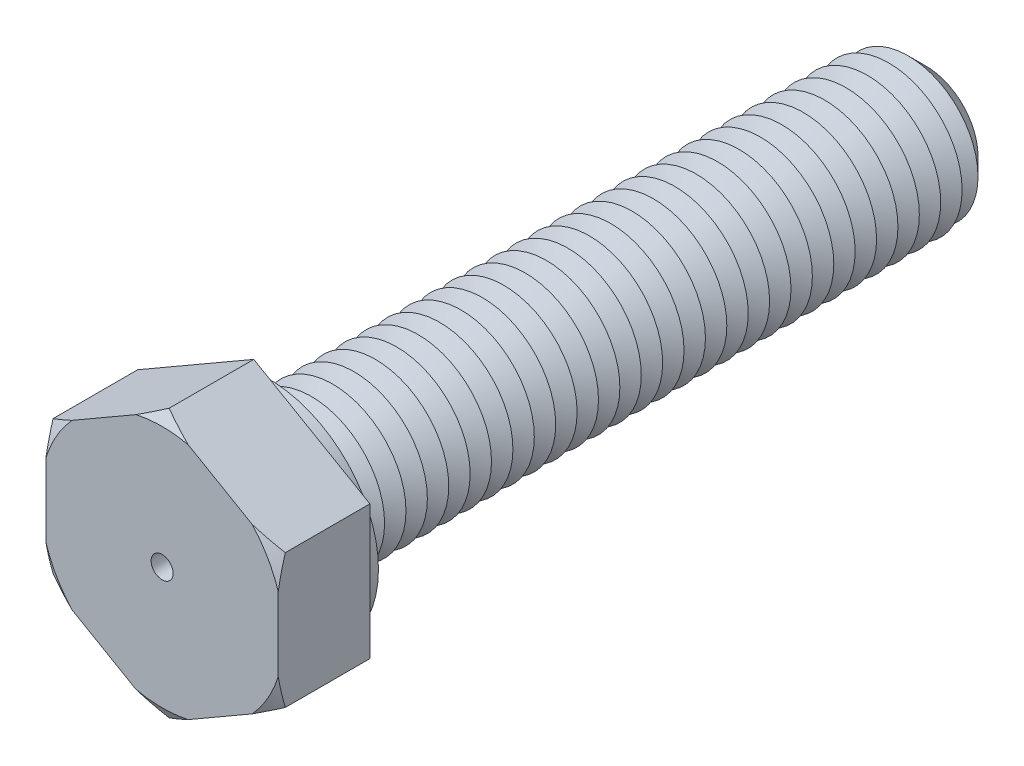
ISO-10303-21;
HEADER;
FILE_DESCRIPTION(('STEP AP214'),'2;1');
FILE_NAME('part.step','',(''),(''),'','','');
FILE_SCHEMA(('AUTOMOTIVE_DESIGN { 1 0 10303 214 1 1 1 1 }'));
ENDSEC;
DATA;
#1=APPLICATION_CONTEXT('core data for automotive mechanical design processes');
#2=APPLICATION_PROTOCOL_DEFINITION('international standard','automotive_design',2000,#1);
#3=PRODUCT_CONTEXT('',#1,'mechanical');
#4=PRODUCT('Part','Part','',(#3));
#5=PRODUCT_RELATED_PRODUCT_CATEGORY('part','',(#4));
#6=PRODUCT_DEFINITION_FORMATION('','',#4);
#7=PRODUCT_DEFINITION_CONTEXT('part definition',#1,'design');
#8=PRODUCT_DEFINITION('design','',#6,#7);
#9=PRODUCT_DEFINITION_SHAPE('','',#8);
#10=(LENGTH_UNIT() NAMED_UNIT(*) SI_UNIT(.MILLI.,.METRE.));
#11=(NAMED_UNIT(*) PLANE_ANGLE_UNIT() SI_UNIT($,.RADIAN.));
#12=(NAMED_UNIT(*) SI_UNIT($,.STERADIAN.) SOLID_ANGLE_UNIT());
#13=UNCERTAINTY_MEASURE_WITH_UNIT(LENGTH_MEASURE(1.E-05),#10,'distance_accuracy_value','');
#14=(GEOMETRIC_REPRESENTATION_CONTEXT(3) GLOBAL_UNCERTAINTY_ASSIGNED_CONTEXT((#13)) GLOBAL_UNIT_ASSIGNED_CONTEXT((#10,
#11,#12)) REPRESENTATION_CONTEXT('',''));
#15=CARTESIAN_POINT('',(0.,0.,0.));
#16=DIRECTION('',(0.,0.,1.));
#17=DIRECTION('',(1.,0.,0.));
#18=AXIS2_PLACEMENT_3D('',#15,#16,#17);
#19=CARTESIAN_POINT('',(9.5,5.48482755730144,7.5));
#20=DIRECTION('',(-0.5,-0.866025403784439,0.));
#21=DIRECTION('',(0.866025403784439,-0.5,0.));
#22=AXIS2_PLACEMENT_3D('',#19,#20,#21);
#23=PLANE('',#22);
#24=CARTESIAN_POINT('',(16.0911028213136,1.67945256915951,3.91531658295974));
#25=CARTESIAN_POINT('',(15.7926530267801,1.85176263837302,4.07633378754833));
#26=CARTESIAN_POINT('',(15.4934885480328,2.02448533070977,4.23561185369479));
#27=CARTESIAN_POINT('',(14.8934288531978,2.37092995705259,4.54987291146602));
#28=CARTESIAN_POINT('',(14.5925334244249,2.54465201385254,4.70485536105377));
#29=CARTESIAN_POINT('',(13.9878148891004,2.89378642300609,5.01015744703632));
#30=CARTESIAN_POINT('',(13.6839854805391,3.06920241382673,5.16046049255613));
#31=CARTESIAN_POINT('',(13.0740489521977,3.4213494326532,5.45475890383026));
#32=CARTESIAN_POINT('',(12.7679419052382,3.59808041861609,5.59875447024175));
#33=CARTESIAN_POINT('',(12.1452865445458,3.95757065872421,5.88261207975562));
#34=CARTESIAN_POINT('',(11.8286703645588,4.14036909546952,6.02227655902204));
#35=CARTESIAN_POINT('',(11.1922429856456,4.50781061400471,6.29164435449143));
#36=CARTESIAN_POINT('',(10.8724316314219,4.69245378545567,6.42134718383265));
#37=CARTESIAN_POINT('',(10.2295404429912,5.06362718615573,6.66831982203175));
#38=CARTESIAN_POINT('',(9.90646410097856,5.25015539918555,6.78560163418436));
#39=CARTESIAN_POINT('',(9.2565183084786,5.62540177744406,7.00502233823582));
#40=CARTESIAN_POINT('',(8.92964935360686,5.81411965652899,7.1071631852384));
#41=CARTESIAN_POINT('',(8.14786487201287,6.26548313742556,7.32807954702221));
#42=CARTESIAN_POINT('',(7.6911273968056,6.52918064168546,7.43861218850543));
#43=CARTESIAN_POINT('',(7.00135730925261,6.92741958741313,7.57140056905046));
#44=CARTESIAN_POINT('',(6.77066782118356,7.06060822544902,7.61016053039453));
#45=CARTESIAN_POINT('',(6.30799755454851,7.3277310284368,7.6757081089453));
#46=CARTESIAN_POINT('',(6.07601678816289,7.46166518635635,7.70249583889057));
#47=CARTESIAN_POINT('',(5.61390562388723,7.72846519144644,7.74308971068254));
#48=CARTESIAN_POINT('',(5.38378495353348,7.86132542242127,7.75704275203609));
#49=CARTESIAN_POINT('',(4.92322735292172,8.1272284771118,7.77208284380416));
#50=CARTESIAN_POINT('',(4.69279042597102,8.26027129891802,7.7731700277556));
#51=CARTESIAN_POINT('',(4.23214422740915,8.52622550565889,7.76244373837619));
#52=CARTESIAN_POINT('',(4.00193495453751,8.65913689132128,7.7506303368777));
#53=CARTESIAN_POINT('',(3.54223236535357,8.92454630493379,7.71446028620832));
#54=CARTESIAN_POINT('',(3.31273916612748,9.05704426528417,7.69010168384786));
#55=CARTESIAN_POINT('',(2.77042202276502,9.37015121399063,7.61833387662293));
#56=CARTESIAN_POINT('',(2.45810922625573,9.55046509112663,7.56573497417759));
#57=CARTESIAN_POINT('',(1.83647686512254,9.90936470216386,7.44074774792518));
#58=CARTESIAN_POINT('',(1.52715774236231,10.087950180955,7.36835654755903));
#59=CARTESIAN_POINT('',(0.911549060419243,10.4433720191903,7.20651778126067));
#60=CARTESIAN_POINT('',(0.605263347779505,10.6202061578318,7.1170509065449));
#61=CARTESIAN_POINT('',(-0.00386858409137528,10.9718886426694,6.92387899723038));
#62=CARTESIAN_POINT('',(-0.30671501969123,11.1467371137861,6.8201748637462));
#63=CARTESIAN_POINT('',(-0.912759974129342,11.496637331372,6.59968787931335));
#64=CARTESIAN_POINT('',(-1.21591973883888,11.6716667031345,6.48276398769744));
#65=CARTESIAN_POINT('',(-1.8190277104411,12.0198712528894,6.23911056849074));
#66=CARTESIAN_POINT('',(-2.11897790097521,12.1930475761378,6.11238754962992));
#67=CARTESIAN_POINT('',(-2.71614501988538,12.5378221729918,5.85087494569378));
#68=CARTESIAN_POINT('',(-3.01336251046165,12.7094207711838,5.71608706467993));
#69=CARTESIAN_POINT('',(-3.60546807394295,13.0512730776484,5.43985672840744));
#70=CARTESIAN_POINT('',(-3.90035610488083,13.2215267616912,5.29841415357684));
#71=CARTESIAN_POINT('',(-4.39671248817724,13.5080982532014,5.05486951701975));
#72=CARTESIAN_POINT('',(-4.59871463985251,13.624724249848,4.95421186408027));
#73=CARTESIAN_POINT('',(-5.00183994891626,13.8574687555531,4.75059724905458));
#74=CARTESIAN_POINT('',(-5.20296313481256,13.9735872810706,4.647640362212));
#75=CARTESIAN_POINT('',(-5.60231741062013,14.2041545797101,4.44078592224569));
#76=CARTESIAN_POINT('',(-5.80055672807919,14.3186081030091,4.33690951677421));
#77=CARTESIAN_POINT('',(-6.19633679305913,14.5471118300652,4.12738601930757));
#78=CARTESIAN_POINT('',(-6.39387752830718,14.6611620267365,4.02173889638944));
#79=CARTESIAN_POINT('',(-6.59110282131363,14.7750301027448,3.91531658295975));
#80=B_SPLINE_CURVE_WITH_KNOTS('',3,(#24,#25,#26,#27,#28,#29,#30,#31,#32,#33,#34,#35,#36,#37,#38,
#39,#40,#41,#42,#43,#44,#45,#46,#47,#48,#49,#50,#51,#52,#53,#54,#55,#56,#57,#58,#59,#60,#61,#62,
#63,#64,#65,#66,#67,#68,#69,#70,#71,#72,#73,#74,#75,#76,#77,#78,#79),.UNSPECIFIED.,.F.,.F.,(4,2,
2,2,2,2,2,2,2,2,2,2,2,2,2,2,2,2,2,2,2,2,2,2,2,2,2,4),(0.,1.14115474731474,2.28245284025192,
3.42741980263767,4.57235031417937,5.74632926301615,6.92036555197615,8.09325673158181,
9.26599632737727,10.8807998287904,11.6881240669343,12.4954407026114,13.2933978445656,
14.0913467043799,14.8892911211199,15.6873598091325,16.7800286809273,17.8728564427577,
18.9669273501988,20.0609290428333,21.1679585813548,22.2742590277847,23.380326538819,
24.4864139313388,25.2485345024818,26.010630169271,26.7647435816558,27.5188701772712),.UNSPECIFIED.);
#81=CARTESIAN_POINT('',(9.5,5.48482755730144,6.92264973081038));
#82=VERTEX_POINT('',#81);
#83=CARTESIAN_POINT('',(7.36878164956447,6.71528704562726,7.5));
#84=VERTEX_POINT('',#83);
#85=EDGE_CURVE('E132',#82,#84,#80,.T.);
#86=ORIENTED_EDGE('',*,*,#85,.F.);
#87=DIRECTION('',(0.,0.,-1.));
#88=VECTOR('',#87,1.);
#89=CARTESIAN_POINT('',(9.5,5.48482755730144,7.5));
#90=LINE('',#89,#88);
#91=CARTESIAN_POINT('',(9.5,5.48482755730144,0.));
#92=VERTEX_POINT('',#91);
#93=EDGE_CURVE('E144',#82,#92,#90,.T.);
#94=ORIENTED_EDGE('',*,*,#93,.T.);
#95=DIRECTION('',(-0.866025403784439,0.5,0.));
#96=VECTOR('',#95,1.);
#97=CARTESIAN_POINT('',(9.5,5.48482755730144,0.));
#98=LINE('',#97,#96);
#99=CARTESIAN_POINT('',(0.,10.9696551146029,0.));
#100=VERTEX_POINT('',#99);
#101=EDGE_CURVE('E442',#92,#100,#98,.T.);
#102=ORIENTED_EDGE('',*,*,#101,.T.);
#103=DIRECTION('',(0.,0.,-1.));
#104=VECTOR('',#103,1.);
#105=CARTESIAN_POINT('',(0.,10.9696551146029,7.5));
#106=LINE('',#105,#104);
#107=CARTESIAN_POINT('',(0.,10.9696551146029,6.92264973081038));
#108=VERTEX_POINT('',#107);
#109=EDGE_CURVE('E179',#108,#100,#106,.T.);
#110=ORIENTED_EDGE('',*,*,#109,.F.);
#111=CARTESIAN_POINT('',(2.13121835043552,9.73919562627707,7.5));
#112=VERTEX_POINT('',#111);
#113=EDGE_CURVE('E151',#112,#108,#80,.T.);
#114=ORIENTED_EDGE('',*,*,#113,.F.);
#115=DIRECTION('',(-0.866025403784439,0.5,0.));
#116=VECTOR('',#115,1.);
#117=CARTESIAN_POINT('',(9.5,5.48482755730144,7.5));
#118=LINE('',#117,#116);
#119=EDGE_CURVE('E148',#84,#112,#118,.T.);
#120=ORIENTED_EDGE('',*,*,#119,.F.);
#121=EDGE_LOOP('',(#86,#94,#102,#110,#114,#120));
#122=FACE_BOUND('',#121,.T.);
#123=ADVANCED_FACE('F39',(#122),#23,.F.);
#124=CARTESIAN_POINT('',(0.,10.9696551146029,7.5));
#125=DIRECTION('',(0.5,-0.866025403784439,0.));
#126=DIRECTION('',(0.866025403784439,0.5,0.));
#127=AXIS2_PLACEMENT_3D('',#124,#125,#126);
#128=PLANE('',#127);
#129=CARTESIAN_POINT('',(6.59110282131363,14.7750301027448,3.91531658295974));
#130=CARTESIAN_POINT('',(6.29265302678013,14.6027200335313,4.07633378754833));
#131=CARTESIAN_POINT('',(5.99348854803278,14.4299973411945,4.23561185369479));
#132=CARTESIAN_POINT('',(5.3934288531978,14.0835527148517,4.54987291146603));
#133=CARTESIAN_POINT('',(5.09253342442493,13.9098306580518,4.70485536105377));
#134=CARTESIAN_POINT('',(4.48781488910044,13.5606962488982,5.01015744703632));
#135=CARTESIAN_POINT('',(4.18398548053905,13.3852802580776,5.16046049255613));
#136=CARTESIAN_POINT('',(3.5740489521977,13.0331332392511,5.45475890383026));
#137=CARTESIAN_POINT('',(3.26794190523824,12.8564022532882,5.59875447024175));
#138=CARTESIAN_POINT('',(2.64528654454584,12.4969120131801,5.88261207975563));
#139=CARTESIAN_POINT('',(2.32867036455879,12.3141135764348,6.02227655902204));
#140=CARTESIAN_POINT('',(1.69224298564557,11.9466720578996,6.29164435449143));
#141=CARTESIAN_POINT('',(1.37243163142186,11.7620288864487,6.42134718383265));
#142=CARTESIAN_POINT('',(0.729540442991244,11.3908554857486,6.66831982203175));
#143=CARTESIAN_POINT('',(0.406464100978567,11.2043272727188,6.78560163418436));
#144=CARTESIAN_POINT('',(-0.243481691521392,10.8290808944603,7.00502233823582));
#145=CARTESIAN_POINT('',(-0.570350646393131,10.6403630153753,7.1071631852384));
#146=CARTESIAN_POINT('',(-1.35213512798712,10.1889995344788,7.32807954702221));
#147=CARTESIAN_POINT('',(-1.80887260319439,9.92530203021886,7.43861218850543));
#148=CARTESIAN_POINT('',(-2.49864269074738,9.52706308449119,7.57140056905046));
#149=CARTESIAN_POINT('',(-2.72933217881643,9.39387444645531,7.61016053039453));
#150=CARTESIAN_POINT('',(-3.19200244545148,9.12675164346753,7.6757081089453));
#151=CARTESIAN_POINT('',(-3.4239832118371,8.99281748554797,7.70249583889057));
#152=CARTESIAN_POINT('',(-3.88609437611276,8.72601748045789,7.74308971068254));
#153=CARTESIAN_POINT('',(-4.11621504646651,8.59315724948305,7.75704275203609));
#154=CARTESIAN_POINT('',(-4.57677264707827,8.32725419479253,7.77208284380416));
#155=CARTESIAN_POINT('',(-4.80720957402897,8.19421137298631,7.7731700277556));
#156=CARTESIAN_POINT('',(-5.26785577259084,7.92825716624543,7.76244373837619));
#157=CARTESIAN_POINT('',(-5.49806504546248,7.79534578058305,7.7506303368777));
#158=CARTESIAN_POINT('',(-5.95776763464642,7.52993636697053,7.71446028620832));
#159=CARTESIAN_POINT('',(-6.18726083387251,7.39743840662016,7.69010168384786));
#160=CARTESIAN_POINT('',(-6.72957797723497,7.0843314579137,7.61833387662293));
#161=CARTESIAN_POINT('',(-7.04189077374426,6.90401758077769,7.56573497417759));
#162=CARTESIAN_POINT('',(-7.66352313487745,6.54511796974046,7.44074774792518));
#163=CARTESIAN_POINT('',(-7.97284225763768,6.36653249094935,7.36835654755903));
#164=CARTESIAN_POINT('',(-8.58845093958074,6.01111065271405,7.20651778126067));
#165=CARTESIAN_POINT('',(-8.89473665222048,5.83427651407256,7.1170509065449));
#166=CARTESIAN_POINT('',(-9.50386858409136,5.48259402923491,6.92387899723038));
#167=CARTESIAN_POINT('',(-9.80671501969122,5.30774555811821,6.8201748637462));
#168=CARTESIAN_POINT('',(-10.4127599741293,4.95784534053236,6.59968787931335));
#169=CARTESIAN_POINT('',(-10.7159197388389,4.78281596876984,6.48276398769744));
#170=CARTESIAN_POINT('',(-11.3190277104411,4.43461141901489,6.23911056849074));
#171=CARTESIAN_POINT('',(-11.6189779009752,4.26143509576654,6.11238754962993));
#172=CARTESIAN_POINT('',(-12.2161450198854,3.91666049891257,5.85087494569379));
#173=CARTESIAN_POINT('',(-12.5133625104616,3.74506190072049,5.71608706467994));
#174=CARTESIAN_POINT('',(-13.1054680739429,3.40320959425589,5.43985672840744));
#175=CARTESIAN_POINT('',(-13.4003561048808,3.2329559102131,5.29841415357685));
#176=CARTESIAN_POINT('',(-13.8967124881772,2.94638441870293,5.05486951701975));
#177=CARTESIAN_POINT('',(-14.0987146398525,2.82975842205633,4.95421186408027));
#178=CARTESIAN_POINT('',(-14.5018399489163,2.59701391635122,4.75059724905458));
#179=CARTESIAN_POINT('',(-14.7029631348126,2.48089539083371,4.647640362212));
#180=CARTESIAN_POINT('',(-15.1023174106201,2.25032809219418,4.44078592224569));
#181=CARTESIAN_POINT('',(-15.3005567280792,2.13587456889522,4.33690951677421));
#182=CARTESIAN_POINT('',(-15.6963367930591,1.90737084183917,4.12738601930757));
#183=CARTESIAN_POINT('',(-15.8938775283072,1.79332064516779,4.02173889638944));
#184=CARTESIAN_POINT('',(-16.0911028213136,1.67945256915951,3.91531658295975));
#185=B_SPLINE_CURVE_WITH_KNOTS('',3,(#129,#130,#131,#132,#133,#134,#135,#136,#137,#138,#139,
#140,#141,#142,#143,#144,#145,#146,#147,#148,#149,#150,#151,#152,#153,#154,#155,#156,#157,#158,
#159,#160,#161,#162,#163,#164,#165,#166,#167,#168,#169,#170,#171,#172,#173,#174,#175,#176,#177,
#178,#179,#180,#181,#182,#183,#184),.UNSPECIFIED.,.F.,.F.,(4,2,2,2,2,2,2,2,2,2,2,2,2,2,2,2,2,2,
2,2,2,2,2,2,2,2,2,4),(0.,1.14115474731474,2.28245284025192,3.42741980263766,4.57235031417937,
5.74632926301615,6.92036555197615,8.09325673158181,9.26599632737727,10.8807998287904,
11.6881240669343,12.4954407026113,13.2933978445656,14.0913467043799,14.8892911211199,
15.6873598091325,16.7800286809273,17.8728564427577,18.9669273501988,20.0609290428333,
21.1679585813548,22.2742590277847,23.380326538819,24.4864139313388,25.2485345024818,
26.010630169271,26.7647435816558,27.5188701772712),.UNSPECIFIED.);
#186=CARTESIAN_POINT('',(-2.13121835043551,9.73919562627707,7.5));
#187=VERTEX_POINT('',#186);
#188=EDGE_CURVE('E1399',#108,#187,#185,.T.);
#189=ORIENTED_EDGE('',*,*,#188,.F.);
#190=ORIENTED_EDGE('',*,*,#109,.T.);
#191=DIRECTION('',(-0.866025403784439,-0.5,0.));
#192=VECTOR('',#191,1.);
#193=CARTESIAN_POINT('',(0.,10.9696551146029,0.));
#194=LINE('',#193,#192);
#195=CARTESIAN_POINT('',(-9.5,5.48482755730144,0.));
#196=VERTEX_POINT('',#195);
#197=EDGE_CURVE('E461',#100,#196,#194,.T.);
#198=ORIENTED_EDGE('',*,*,#197,.T.);
#199=DIRECTION('',(0.,0.,-1.));
#200=VECTOR('',#199,1.);
#201=CARTESIAN_POINT('',(-9.5,5.48482755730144,7.5));
#202=LINE('',#201,#200);
#203=CARTESIAN_POINT('',(-9.5,5.48482755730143,6.92264973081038));
#204=VERTEX_POINT('',#203);
#205=EDGE_CURVE('E176',#204,#196,#202,.T.);
#206=ORIENTED_EDGE('',*,*,#205,.F.);
#207=CARTESIAN_POINT('',(-7.36878164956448,6.71528704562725,7.5));
#208=VERTEX_POINT('',#207);
#209=EDGE_CURVE('E537',#208,#204,#185,.T.);
#210=ORIENTED_EDGE('',*,*,#209,.F.);
#211=DIRECTION('',(-0.866025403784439,-0.5,0.));
#212=VECTOR('',#211,1.);
#213=CARTESIAN_POINT('',(0.,10.9696551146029,7.5));
#214=LINE('',#213,#212);
#215=EDGE_CURVE('E445',#187,#208,#214,.T.);
#216=ORIENTED_EDGE('',*,*,#215,.F.);
#217=EDGE_LOOP('',(#189,#190,#198,#206,#210,#216));
#218=FACE_BOUND('',#217,.T.);
#219=ADVANCED_FACE('F546',(#218),#128,.F.);
#220=CARTESIAN_POINT('',(-9.5,5.48482755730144,7.5));
#221=DIRECTION('',(1.,0.,0.));
#222=DIRECTION('',(0.,1.,0.));
#223=AXIS2_PLACEMENT_3D('',#220,#221,#222);
#224=PLANE('',#223);
#225=CARTESIAN_POINT('',(-9.5,12.0759303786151,4.38509256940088));
#226=CARTESIAN_POINT('',(-9.5,11.7327439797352,4.5407773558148));
#227=CARTESIAN_POINT('',(-9.5,11.388618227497,4.69443095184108));
#228=CARTESIAN_POINT('',(-9.5,10.698085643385,4.99669009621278));
#229=CARTESIAN_POINT('',(-9.5,10.3516784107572,5.1452947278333));
#230=CARTESIAN_POINT('',(-9.5,9.65484997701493,5.43702212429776));
#231=CARTESIAN_POINT('',(-9.5,9.30441804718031,5.58011936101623));
#232=CARTESIAN_POINT('',(-9.5,8.60059023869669,5.85880989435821));
#233=CARTESIAN_POINT('',(-9.5,8.24719449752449,5.9944035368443));
#234=CARTESIAN_POINT('',(-9.5,7.53860340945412,6.25582574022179));
#235=CARTESIAN_POINT('',(-9.5,7.18342337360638,6.38169559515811));
#236=CARTESIAN_POINT('',(-9.5,6.46926569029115,6.62229858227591));
#237=CARTESIAN_POINT('',(-9.5,6.11028785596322,6.73703116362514));
#238=CARTESIAN_POINT('',(-9.5,5.38872372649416,6.95272419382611));
#239=CARTESIAN_POINT('',(-9.5,5.02614305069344,7.05370330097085));
#240=CARTESIAN_POINT('',(-9.5,4.29675196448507,7.23920160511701));
#241=CARTESIAN_POINT('',(-9.5,3.92994173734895,7.32372151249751));
#242=CARTESIAN_POINT('',(-9.5,3.29665308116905,7.45205940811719));
#243=CARTESIAN_POINT('',(-9.5,3.03113701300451,7.50062833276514));
#244=CARTESIAN_POINT('',(-9.5,2.49832809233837,7.5865841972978));
#245=CARTESIAN_POINT('',(-9.5,2.23103554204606,7.62397299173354));
#246=CARTESIAN_POINT('',(-9.5,1.69506861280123,7.68659004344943));
#247=CARTESIAN_POINT('',(-9.5,1.42639449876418,7.71182055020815));
#248=CARTESIAN_POINT('',(-9.5,0.888138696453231,7.74939803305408));
#249=CARTESIAN_POINT('',(-9.5,0.618557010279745,7.76174503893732));
#250=CARTESIAN_POINT('',(-9.5,0.0792458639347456,7.77317034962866));
#251=CARTESIAN_POINT('',(-9.5,-0.190483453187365,7.77225534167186));
#252=CARTESIAN_POINT('',(-9.5,-0.729567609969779,7.75720205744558));
#253=CARTESIAN_POINT('',(-9.5,-0.998922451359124,7.74306384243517));
#254=CARTESIAN_POINT('',(-9.5,-1.53667618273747,7.70199575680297));
#255=CARTESIAN_POINT('',(-9.5,-1.80507496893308,7.67506453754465));
#256=CARTESIAN_POINT('',(-9.5,-2.34038611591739,7.60918517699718));
#257=CARTESIAN_POINT('',(-9.5,-2.60729841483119,7.57023653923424));
#258=CARTESIAN_POINT('',(-9.5,-3.27166409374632,7.45918941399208));
#259=CARTESIAN_POINT('',(-9.5,-3.66797754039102,7.38023980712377));
#260=CARTESIAN_POINT('',(-9.5,-4.45585575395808,7.20141943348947));
#261=CARTESIAN_POINT('',(-9.5,-4.8474194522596,7.10154404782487));
#262=CARTESIAN_POINT('',(-9.5,-5.6265713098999,6.88438943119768));
#263=CARTESIAN_POINT('',(-9.5,-6.01414884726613,6.76707245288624));
#264=CARTESIAN_POINT('',(-9.5,-6.78474185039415,6.51851091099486));
#265=CARTESIAN_POINT('',(-9.5,-7.16775763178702,6.38726731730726));
#266=CARTESIAN_POINT('',(-9.5,-7.93407213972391,6.11202298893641));
#267=CARTESIAN_POINT('',(-9.5,-8.31732458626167,5.96789419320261));
#268=CARTESIAN_POINT('',(-9.5,-9.08024927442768,5.67043108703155));
#269=CARTESIAN_POINT('',(-9.5,-9.4599212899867,5.51709619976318));
#270=CARTESIAN_POINT('',(-9.5,-10.2138362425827,5.20397874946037));
#271=CARTESIAN_POINT('',(-9.5,-10.5880982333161,5.04424191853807));
#272=CARTESIAN_POINT('',(-9.5,-11.1474871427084,4.80018423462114));
#273=CARTESIAN_POINT('',(-9.5,-11.3335947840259,4.71809930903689));
#274=CARTESIAN_POINT('',(-9.5,-11.7052038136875,4.55257683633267));
#275=CARTESIAN_POINT('',(-9.5,-11.8907052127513,4.46913931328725));
#276=CARTESIAN_POINT('',(-9.5,-12.0759303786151,4.38509256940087));
#277=B_SPLINE_CURVE_WITH_KNOTS('',3,(#225,#226,#227,#228,#229,#230,#231,#232,#233,#234,#235,
#236,#237,#238,#239,#240,#241,#242,#243,#244,#245,#246,#247,#248,#249,#250,#251,#252,#253,#254,
#255,#256,#257,#258,#259,#260,#261,#262,#263,#264,#265,#266,#267,#268,#269,#270,#271,#272,#273,
#274,#275,#276),.UNSPECIFIED.,.F.,.F.,(4,2,2,2,2,2,2,2,2,2,2,2,2,2,2,2,2,2,2,2,2,2,2,2,2,4),(0.,
1.13056270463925,2.26132959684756,3.39682602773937,4.53227007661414,5.66259174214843,
6.79296928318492,7.92179771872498,9.0505774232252,9.86013572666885,10.6695596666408,
11.4788337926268,12.288106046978,13.0969702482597,13.9058307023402,14.7147764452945,
15.5237556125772,16.7353316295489,17.9471753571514,19.1616810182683,20.3761021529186,
21.6043286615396,22.8326322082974,24.0533405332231,24.6635541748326,25.273756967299),.UNSPECIFIED.);
#278=CARTESIAN_POINT('',(-9.5,3.02390858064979,7.5));
#279=VERTEX_POINT('',#278);
#280=EDGE_CURVE('E535',#204,#279,#277,.T.);
#281=ORIENTED_EDGE('',*,*,#280,.F.);
#282=ORIENTED_EDGE('',*,*,#205,.T.);
#283=DIRECTION('',(0.,-1.,0.));
#284=VECTOR('',#283,1.);
#285=CARTESIAN_POINT('',(-9.5,5.48482755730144,0.));
#286=LINE('',#285,#284);
#287=CARTESIAN_POINT('',(-9.5,-5.48482755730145,0.));
#288=VERTEX_POINT('',#287);
#289=EDGE_CURVE('E465',#196,#288,#286,.T.);
#290=ORIENTED_EDGE('',*,*,#289,.T.);
#291=DIRECTION('',(0.,0.,-1.));
#292=VECTOR('',#291,1.);
#293=CARTESIAN_POINT('',(-9.5,-5.48482755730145,7.5));
#294=LINE('',#293,#292);
#295=CARTESIAN_POINT('',(-9.49999999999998,-5.48482755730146,6.92264973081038));
#296=VERTEX_POINT('',#295);
#297=EDGE_CURVE('E173',#296,#288,#294,.T.);
#298=ORIENTED_EDGE('',*,*,#297,.F.);
#299=CARTESIAN_POINT('',(-9.5,-3.02390858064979,7.5));
#300=VERTEX_POINT('',#299);
#301=EDGE_CURVE('E529',#300,#296,#277,.T.);
#302=ORIENTED_EDGE('',*,*,#301,.F.);
#303=DIRECTION('',(0.,-1.,0.));
#304=VECTOR('',#303,1.);
#305=CARTESIAN_POINT('',(-9.5,5.48482755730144,7.5));
#306=LINE('',#305,#304);
#307=EDGE_CURVE('E449',#279,#300,#306,.T.);
#308=ORIENTED_EDGE('',*,*,#307,.F.);
#309=EDGE_LOOP('',(#281,#282,#290,#298,#302,#308));
#310=FACE_BOUND('',#309,.T.);
#311=ADVANCED_FACE('F542',(#310),#224,.F.);
#312=CARTESIAN_POINT('',(-9.5,-5.48482755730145,7.5));
#313=DIRECTION('',(0.5,0.866025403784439,0.));
#314=DIRECTION('',(-0.866025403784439,0.5,0.));
#315=AXIS2_PLACEMENT_3D('',#312,#313,#314);
#316=PLANE('',#315);
#317=CARTESIAN_POINT('',(-16.0911028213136,-1.67945256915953,3.91531658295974));
#318=CARTESIAN_POINT('',(-15.7926530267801,-1.85176263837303,4.07633378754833));
#319=CARTESIAN_POINT('',(-15.4934885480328,-2.02448533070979,4.23561185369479));
#320=CARTESIAN_POINT('',(-14.8934288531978,-2.37092995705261,4.54987291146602));
#321=CARTESIAN_POINT('',(-14.5925334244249,-2.54465201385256,4.70485536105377));
#322=CARTESIAN_POINT('',(-13.9878148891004,-2.89378642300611,5.01015744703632));
#323=CARTESIAN_POINT('',(-13.683985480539,-3.06920241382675,5.16046049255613));
#324=CARTESIAN_POINT('',(-13.0740489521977,-3.42134943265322,5.45475890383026));
#325=CARTESIAN_POINT('',(-12.7679419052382,-3.5980804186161,5.59875447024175));
#326=CARTESIAN_POINT('',(-12.1452865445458,-3.95757065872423,5.88261207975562));
#327=CARTESIAN_POINT('',(-11.8286703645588,-4.14036909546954,6.02227655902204));
#328=CARTESIAN_POINT('',(-11.1922429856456,-4.50781061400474,6.29164435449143));
#329=CARTESIAN_POINT('',(-10.8724316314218,-4.69245378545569,6.42134718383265));
#330=CARTESIAN_POINT('',(-10.2295404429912,-5.06362718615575,6.66831982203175));
#331=CARTESIAN_POINT('',(-9.90646410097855,-5.25015539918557,6.78560163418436));
#332=CARTESIAN_POINT('',(-9.25651830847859,-5.62540177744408,7.00502233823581));
#333=CARTESIAN_POINT('',(-8.92964935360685,-5.81411965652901,7.1071631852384));
#334=CARTESIAN_POINT('',(-8.14786487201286,-6.26548313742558,7.32807954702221));
#335=CARTESIAN_POINT('',(-7.69112739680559,-6.52918064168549,7.43861218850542));
#336=CARTESIAN_POINT('',(-7.0013573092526,-6.92741958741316,7.57140056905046));
#337=CARTESIAN_POINT('',(-6.77066782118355,-7.06060822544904,7.61016053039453));
#338=CARTESIAN_POINT('',(-6.3079975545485,-7.32773102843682,7.6757081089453));
#339=CARTESIAN_POINT('',(-6.07601678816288,-7.46166518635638,7.70249583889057));
#340=CARTESIAN_POINT('',(-5.61390562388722,-7.72846519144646,7.74308971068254));
#341=CARTESIAN_POINT('',(-5.38378495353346,-7.8613254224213,7.75704275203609));
#342=CARTESIAN_POINT('',(-4.9232273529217,-8.12722847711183,7.77208284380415));
#343=CARTESIAN_POINT('',(-4.692790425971,-8.26027129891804,7.77317002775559));
#344=CARTESIAN_POINT('',(-4.23214422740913,-8.52622550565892,7.76244373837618));
#345=CARTESIAN_POINT('',(-4.00193495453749,-8.6591368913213,7.75063033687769));
#346=CARTESIAN_POINT('',(-3.54223236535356,-8.92454630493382,7.71446028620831));
#347=CARTESIAN_POINT('',(-3.31273916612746,-9.05704426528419,7.69010168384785));
#348=CARTESIAN_POINT('',(-2.770422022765,-9.37015121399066,7.61833387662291));
#349=CARTESIAN_POINT('',(-2.45810922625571,-9.55046509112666,7.56573497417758));
#350=CARTESIAN_POINT('',(-1.83647686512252,-9.9093647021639,7.44074774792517));
#351=CARTESIAN_POINT('',(-1.52715774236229,-10.087950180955,7.36835654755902));
#352=CARTESIAN_POINT('',(-0.911549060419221,-10.4433720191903,7.20651778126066));
#353=CARTESIAN_POINT('',(-0.605263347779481,-10.6202061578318,7.11705090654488));
#354=CARTESIAN_POINT('',(0.00386858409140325,-10.9718886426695,6.92387899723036));
#355=CARTESIAN_POINT('',(0.30671501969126,-11.1467371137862,6.82017486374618));
#356=CARTESIAN_POINT('',(0.912759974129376,-11.496637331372,6.59968787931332));
#357=CARTESIAN_POINT('',(1.21591973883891,-11.6716667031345,6.48276398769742));
#358=CARTESIAN_POINT('',(1.81902771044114,-12.0198712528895,6.23911056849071));
#359=CARTESIAN_POINT('',(2.11897790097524,-12.1930475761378,6.11238754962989));
#360=CARTESIAN_POINT('',(2.71614501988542,-12.5378221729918,5.85087494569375));
#361=CARTESIAN_POINT('',(3.01336251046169,-12.7094207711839,5.7160870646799));
#362=CARTESIAN_POINT('',(3.60546807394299,-13.0512730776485,5.4398567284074));
#363=CARTESIAN_POINT('',(3.90035610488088,-13.2215267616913,5.29841415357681));
#364=CARTESIAN_POINT('',(4.39671248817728,-13.5080982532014,5.05486951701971));
#365=CARTESIAN_POINT('',(4.59871463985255,-13.624724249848,4.95421186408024));
#366=CARTESIAN_POINT('',(5.00183994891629,-13.8574687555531,4.75059724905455));
#367=CARTESIAN_POINT('',(5.20296313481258,-13.9735872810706,4.64764036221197));
#368=CARTESIAN_POINT('',(5.60231741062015,-14.2041545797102,4.44078592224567));
#369=CARTESIAN_POINT('',(5.8005567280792,-14.3186081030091,4.33690951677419));
#370=CARTESIAN_POINT('',(6.19633679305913,-14.5471118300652,4.12738601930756));
#371=CARTESIAN_POINT('',(6.39387752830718,-14.6611620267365,4.02173889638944));
#372=CARTESIAN_POINT('',(6.59110282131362,-14.7750301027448,3.91531658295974));
#373=B_SPLINE_CURVE_WITH_KNOTS('',3,(#317,#318,#319,#320,#321,#322,#323,#324,#325,#326,#327,
#328,#329,#330,#331,#332,#333,#334,#335,#336,#337,#338,#339,#340,#341,#342,#343,#344,#345,#346,
#347,#348,#349,#350,#351,#352,#353,#354,#355,#356,#357,#358,#359,#360,#361,#362,#363,#364,#365,
#366,#367,#368,#369,#370,#371,#372),.UNSPECIFIED.,.F.,.F.,(4,2,2,2,2,2,2,2,2,2,2,2,2,2,2,2,2,2,
2,2,2,2,2,2,2,2,2,4),(0.,1.14115474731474,2.28245284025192,3.42741980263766,4.57235031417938,
5.74632926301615,6.92036555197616,8.09325673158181,9.26599632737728,10.8807998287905,
11.6881240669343,12.4954407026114,13.2933978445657,14.0913467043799,14.8892911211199,
15.6873598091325,16.7800286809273,17.8728564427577,18.9669273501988,20.0609290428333,
21.1679585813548,22.2742590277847,23.3803265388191,24.4864139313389,25.2485345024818,
26.010630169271,26.7647435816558,27.5188701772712),.UNSPECIFIED.);
#374=CARTESIAN_POINT('',(-7.36878164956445,-6.71528704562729,7.5));
#375=VERTEX_POINT('',#374);
#376=EDGE_CURVE('E536',#296,#375,#373,.T.);
#377=ORIENTED_EDGE('',*,*,#376,.F.);
#378=ORIENTED_EDGE('',*,*,#297,.T.);
#379=DIRECTION('',(0.866025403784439,-0.5,0.));
#380=VECTOR('',#379,1.);
#381=CARTESIAN_POINT('',(-9.5,-5.48482755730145,0.));
#382=LINE('',#381,#380);
#383=CARTESIAN_POINT('',(0.,-10.9696551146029,0.));
#384=VERTEX_POINT('',#383);
#385=EDGE_CURVE('E469',#288,#384,#382,.T.);
#386=ORIENTED_EDGE('',*,*,#385,.T.);
#387=DIRECTION('',(0.,0.,-1.));
#388=VECTOR('',#387,1.);
#389=CARTESIAN_POINT('',(0.,-10.9696551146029,7.5));
#390=LINE('',#389,#388);
#391=CARTESIAN_POINT('',(0.,-10.9696551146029,6.92264973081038));
#392=VERTEX_POINT('',#391);
#393=EDGE_CURVE('E163',#392,#384,#390,.T.);
#394=ORIENTED_EDGE('',*,*,#393,.F.);
#395=CARTESIAN_POINT('',(-2.13121835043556,-9.73919562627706,7.5));
#396=VERTEX_POINT('',#395);
#397=EDGE_CURVE('E523',#396,#392,#373,.T.);
#398=ORIENTED_EDGE('',*,*,#397,.F.);
#399=DIRECTION('',(0.866025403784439,-0.5,0.));
#400=VECTOR('',#399,1.);
#401=CARTESIAN_POINT('',(-9.5,-5.48482755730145,7.5));
#402=LINE('',#401,#400);
#403=EDGE_CURVE('E453',#375,#396,#402,.T.);
#404=ORIENTED_EDGE('',*,*,#403,.F.);
#405=EDGE_LOOP('',(#377,#378,#386,#394,#398,#404));
#406=FACE_BOUND('',#405,.T.);
#407=ADVANCED_FACE('F545',(#406),#316,.F.);
#408=CARTESIAN_POINT('',(0.,-10.9696551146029,7.5));
#409=DIRECTION('',(-0.5,0.866025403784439,0.));
#410=DIRECTION('',(-0.866025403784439,-0.5,0.));
#411=AXIS2_PLACEMENT_3D('',#408,#409,#410);
#412=PLANE('',#411);
#413=CARTESIAN_POINT('',(-6.59110282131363,-14.7750301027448,3.91531658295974));
#414=CARTESIAN_POINT('',(-6.29265302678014,-14.6027200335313,4.07633378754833));
#415=CARTESIAN_POINT('',(-5.99348854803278,-14.4299973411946,4.23561185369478));
#416=CARTESIAN_POINT('',(-5.3934288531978,-14.0835527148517,4.54987291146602));
#417=CARTESIAN_POINT('',(-5.09253342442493,-13.9098306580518,4.70485536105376));
#418=CARTESIAN_POINT('',(-4.48781488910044,-13.5606962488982,5.01015744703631));
#419=CARTESIAN_POINT('',(-4.18398548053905,-13.3852802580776,5.16046049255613));
#420=CARTESIAN_POINT('',(-3.5740489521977,-13.0331332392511,5.45475890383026));
#421=CARTESIAN_POINT('',(-3.26794190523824,-12.8564022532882,5.59875447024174));
#422=CARTESIAN_POINT('',(-2.64528654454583,-12.4969120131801,5.88261207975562));
#423=CARTESIAN_POINT('',(-2.32867036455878,-12.3141135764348,6.02227655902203));
#424=CARTESIAN_POINT('',(-1.69224298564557,-11.9466720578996,6.29164435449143));
#425=CARTESIAN_POINT('',(-1.37243163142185,-11.7620288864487,6.42134718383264));
#426=CARTESIAN_POINT('',(-0.729540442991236,-11.3908554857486,6.66831982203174));
#427=CARTESIAN_POINT('',(-0.406464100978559,-11.2043272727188,6.78560163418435));
#428=CARTESIAN_POINT('',(0.243481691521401,-10.8290808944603,7.00502233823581));
#429=CARTESIAN_POINT('',(0.570350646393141,-10.6403630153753,7.10716318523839));
#430=CARTESIAN_POINT('',(1.35213512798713,-10.1889995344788,7.3280795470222));
#431=CARTESIAN_POINT('',(1.8088726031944,-9.92530203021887,7.43861218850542));
#432=CARTESIAN_POINT('',(2.49864269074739,-9.5270630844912,7.57140056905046));
#433=CARTESIAN_POINT('',(2.72933217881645,-9.39387444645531,7.61016053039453));
#434=CARTESIAN_POINT('',(3.19200244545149,-9.12675164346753,7.6757081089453));
#435=CARTESIAN_POINT('',(3.42398321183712,-8.99281748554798,7.70249583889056));
#436=CARTESIAN_POINT('',(3.88609437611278,-8.72601748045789,7.74308971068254));
#437=CARTESIAN_POINT('',(4.11621504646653,-8.59315724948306,7.75704275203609));
#438=CARTESIAN_POINT('',(4.57677264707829,-8.32725419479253,7.77208284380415));
#439=CARTESIAN_POINT('',(4.80720957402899,-8.19421137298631,7.77317002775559));
#440=CARTESIAN_POINT('',(5.26785577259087,-7.92825716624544,7.76244373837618));
#441=CARTESIAN_POINT('',(5.4980650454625,-7.79534578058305,7.75063033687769));
#442=CARTESIAN_POINT('',(5.95776763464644,-7.52993636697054,7.71446028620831));
#443=CARTESIAN_POINT('',(6.18726083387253,-7.39743840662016,7.69010168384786));
#444=CARTESIAN_POINT('',(6.72957797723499,-7.0843314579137,7.61833387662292));
#445=CARTESIAN_POINT('',(7.04189077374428,-6.9040175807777,7.56573497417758));
#446=CARTESIAN_POINT('',(7.66352313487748,-6.54511796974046,7.44074774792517));
#447=CARTESIAN_POINT('',(7.97284225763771,-6.36653249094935,7.36835654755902));
#448=CARTESIAN_POINT('',(8.58845093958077,-6.01111065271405,7.20651778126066));
#449=CARTESIAN_POINT('',(8.89473665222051,-5.83427651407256,7.11705090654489));
#450=CARTESIAN_POINT('',(9.50386858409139,-5.48259402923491,6.92387899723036));
#451=CARTESIAN_POINT('',(9.80671501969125,-5.30774555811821,6.82017486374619));
#452=CARTESIAN_POINT('',(10.4127599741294,-4.95784534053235,6.59968787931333));
#453=CARTESIAN_POINT('',(10.7159197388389,-4.78281596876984,6.48276398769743));
#454=CARTESIAN_POINT('',(11.3190277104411,-4.43461141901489,6.23911056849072));
#455=CARTESIAN_POINT('',(11.6189779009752,-4.26143509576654,6.1123875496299));
#456=CARTESIAN_POINT('',(12.2161450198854,-3.91666049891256,5.85087494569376));
#457=CARTESIAN_POINT('',(12.5133625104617,-3.74506190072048,5.71608706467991));
#458=CARTESIAN_POINT('',(13.105468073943,-3.40320959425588,5.43985672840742));
#459=CARTESIAN_POINT('',(13.4003561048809,-3.23295591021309,5.29841415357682));
#460=CARTESIAN_POINT('',(13.8967124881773,-2.94638441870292,5.05486951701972));
#461=CARTESIAN_POINT('',(14.0987146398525,-2.82975842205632,4.95421186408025));
#462=CARTESIAN_POINT('',(14.5018399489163,-2.59701391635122,4.75059724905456));
#463=CARTESIAN_POINT('',(14.7029631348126,-2.48089539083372,4.64764036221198));
#464=CARTESIAN_POINT('',(15.1023174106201,-2.25032809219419,4.44078592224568));
#465=CARTESIAN_POINT('',(15.3005567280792,-2.13587456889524,4.3369095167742));
#466=CARTESIAN_POINT('',(15.6963367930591,-1.90737084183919,4.12738601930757));
#467=CARTESIAN_POINT('',(15.8938775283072,-1.79332064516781,4.02173889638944));
#468=CARTESIAN_POINT('',(16.0911028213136,-1.67945256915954,3.91531658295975));
#469=B_SPLINE_CURVE_WITH_KNOTS('',3,(#413,#414,#415,#416,#417,#418,#419,#420,#421,#422,#423,
#424,#425,#426,#427,#428,#429,#430,#431,#432,#433,#434,#435,#436,#437,#438,#439,#440,#441,#442,
#443,#444,#445,#446,#447,#448,#449,#450,#451,#452,#453,#454,#455,#456,#457,#458,#459,#460,#461,
#462,#463,#464,#465,#466,#467,#468),.UNSPECIFIED.,.F.,.F.,(4,2,2,2,2,2,2,2,2,2,2,2,2,2,2,2,2,2,
2,2,2,2,2,2,2,2,2,4),(0.,1.14115474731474,2.28245284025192,3.42741980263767,4.57235031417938,
5.74632926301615,6.92036555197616,8.09325673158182,9.26599632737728,10.8807998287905,
11.6881240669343,12.4954407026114,13.2933978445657,14.0913467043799,14.8892911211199,
15.6873598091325,16.7800286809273,17.8728564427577,18.9669273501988,20.0609290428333,
21.1679585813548,22.2742590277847,23.3803265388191,24.4864139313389,25.2485345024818,
26.010630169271,26.7647435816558,27.5188701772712),.UNSPECIFIED.);
#470=CARTESIAN_POINT('',(2.13121835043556,-9.73919562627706,7.5));
#471=VERTEX_POINT('',#470);
#472=EDGE_CURVE('E64',#392,#471,#469,.T.);
#473=ORIENTED_EDGE('',*,*,#472,.F.);
#474=ORIENTED_EDGE('',*,*,#393,.T.);
#475=DIRECTION('',(0.866025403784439,0.5,0.));
#476=VECTOR('',#475,1.);
#477=CARTESIAN_POINT('',(0.,-10.9696551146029,0.));
#478=LINE('',#477,#476);
#479=CARTESIAN_POINT('',(9.5,-5.48482755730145,0.));
#480=VERTEX_POINT('',#479);
#481=EDGE_CURVE('E472',#384,#480,#478,.T.);
#482=ORIENTED_EDGE('',*,*,#481,.T.);
#483=DIRECTION('',(0.,0.,-1.));
#484=VECTOR('',#483,1.);
#485=CARTESIAN_POINT('',(9.5,-5.48482755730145,7.5));
#486=LINE('',#485,#484);
#487=CARTESIAN_POINT('',(9.5,-5.48482755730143,6.92264973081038));
#488=VERTEX_POINT('',#487);
#489=EDGE_CURVE('E157',#488,#480,#486,.T.);
#490=ORIENTED_EDGE('',*,*,#489,.F.);
#491=CARTESIAN_POINT('',(7.36878164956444,-6.71528704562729,7.5));
#492=VERTEX_POINT('',#491);
#493=EDGE_CURVE('E518',#492,#488,#469,.T.);
#494=ORIENTED_EDGE('',*,*,#493,.F.);
#495=DIRECTION('',(0.866025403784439,0.5,0.));
#496=VECTOR('',#495,1.);
#497=CARTESIAN_POINT('',(0.,-10.9696551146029,7.5));
#498=LINE('',#497,#496);
#499=EDGE_CURVE('E166',#471,#492,#498,.T.);
#500=ORIENTED_EDGE('',*,*,#499,.F.);
#501=EDGE_LOOP('',(#473,#474,#482,#490,#494,#500));
#502=FACE_BOUND('',#501,.T.);
#503=ADVANCED_FACE('F567',(#502),#412,.F.);
#504=CARTESIAN_POINT('',(9.5,-5.48482755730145,7.5));
#505=DIRECTION('',(-1.,0.,0.));
#506=DIRECTION('',(0.,-1.,0.));
#507=AXIS2_PLACEMENT_3D('',#504,#505,#506);
#508=PLANE('',#507);
#509=CARTESIAN_POINT('',(9.5,-12.0759303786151,4.38509256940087));
#510=CARTESIAN_POINT('',(9.5,-11.7327439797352,4.54077735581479));
#511=CARTESIAN_POINT('',(9.5,-11.388618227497,4.69443095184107));
#512=CARTESIAN_POINT('',(9.5,-10.698085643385,4.99669009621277));
#513=CARTESIAN_POINT('',(9.5,-10.3516784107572,5.14529472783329));
#514=CARTESIAN_POINT('',(9.5,-9.65484997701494,5.43702212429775));
#515=CARTESIAN_POINT('',(9.5,-9.30441804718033,5.58011936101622));
#516=CARTESIAN_POINT('',(9.5,-8.60059023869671,5.8588098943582));
#517=CARTESIAN_POINT('',(9.5,-8.2471944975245,5.99440353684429));
#518=CARTESIAN_POINT('',(9.5,-7.53860340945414,6.25582574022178));
#519=CARTESIAN_POINT('',(9.5,-7.18342337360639,6.3816955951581));
#520=CARTESIAN_POINT('',(9.5,-6.46926569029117,6.6222985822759));
#521=CARTESIAN_POINT('',(9.5,-6.11028785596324,6.73703116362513));
#522=CARTESIAN_POINT('',(9.5,-5.38872372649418,6.95272419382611));
#523=CARTESIAN_POINT('',(9.5,-5.02614305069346,7.05370330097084));
#524=CARTESIAN_POINT('',(9.5,-4.29675196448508,7.239201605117));
#525=CARTESIAN_POINT('',(9.5,-3.92994173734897,7.32372151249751));
#526=CARTESIAN_POINT('',(9.5,-3.29665308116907,7.45205940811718));
#527=CARTESIAN_POINT('',(9.5,-3.03113701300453,7.50062833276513));
#528=CARTESIAN_POINT('',(9.5,-2.49832809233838,7.5865841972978));
#529=CARTESIAN_POINT('',(9.5,-2.23103554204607,7.62397299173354));
#530=CARTESIAN_POINT('',(9.5,-1.69506861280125,7.68659004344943));
#531=CARTESIAN_POINT('',(9.5,-1.4263944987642,7.71182055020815));
#532=CARTESIAN_POINT('',(9.5,-0.888138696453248,7.74939803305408));
#533=CARTESIAN_POINT('',(9.5,-0.618557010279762,7.76174503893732));
#534=CARTESIAN_POINT('',(9.5,-0.0792458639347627,7.77317034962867));
#535=CARTESIAN_POINT('',(9.5,0.190483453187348,7.77225534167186));
#536=CARTESIAN_POINT('',(9.5,0.729567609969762,7.75720205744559));
#537=CARTESIAN_POINT('',(9.5,0.998922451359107,7.74306384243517));
#538=CARTESIAN_POINT('',(9.5,1.53667618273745,7.70199575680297));
#539=CARTESIAN_POINT('',(9.5,1.80507496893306,7.67506453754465));
#540=CARTESIAN_POINT('',(9.5,2.34038611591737,7.60918517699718));
#541=CARTESIAN_POINT('',(9.5,2.60729841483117,7.57023653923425));
#542=CARTESIAN_POINT('',(9.5,3.2716640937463,7.45918941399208));
#543=CARTESIAN_POINT('',(9.5,3.667977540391,7.38023980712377));
#544=CARTESIAN_POINT('',(9.5,4.45585575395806,7.20141943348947));
#545=CARTESIAN_POINT('',(9.5,4.84741945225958,7.10154404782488));
#546=CARTESIAN_POINT('',(9.5,5.62657130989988,6.88438943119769));
#547=CARTESIAN_POINT('',(9.5,6.01414884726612,6.76707245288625));
#548=CARTESIAN_POINT('',(9.5,6.78474185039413,6.51851091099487));
#549=CARTESIAN_POINT('',(9.5,7.167757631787,6.38726731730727));
#550=CARTESIAN_POINT('',(9.5,7.93407213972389,6.11202298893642));
#551=CARTESIAN_POINT('',(9.5,8.31732458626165,5.96789419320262));
#552=CARTESIAN_POINT('',(9.5,9.08024927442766,5.67043108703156));
#553=CARTESIAN_POINT('',(9.5,9.45992128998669,5.51709619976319));
#554=CARTESIAN_POINT('',(9.5,10.2138362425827,5.20397874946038));
#555=CARTESIAN_POINT('',(9.5,10.5880982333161,5.04424191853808));
#556=CARTESIAN_POINT('',(9.5,11.1474871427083,4.80018423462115));
#557=CARTESIAN_POINT('',(9.5,11.3335947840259,4.7180993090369));
#558=CARTESIAN_POINT('',(9.5,11.7052038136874,4.55257683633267));
#559=CARTESIAN_POINT('',(9.5,11.8907052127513,4.46913931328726));
#560=CARTESIAN_POINT('',(9.5,12.0759303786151,4.38509256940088));
#561=B_SPLINE_CURVE_WITH_KNOTS('',3,(#509,#510,#511,#512,#513,#514,#515,#516,#517,#518,#519,
#520,#521,#522,#523,#524,#525,#526,#527,#528,#529,#530,#531,#532,#533,#534,#535,#536,#537,#538,
#539,#540,#541,#542,#543,#544,#545,#546,#547,#548,#549,#550,#551,#552,#553,#554,#555,#556,#557,
#558,#559,#560),.UNSPECIFIED.,.F.,.F.,(4,2,2,2,2,2,2,2,2,2,2,2,2,2,2,2,2,2,2,2,2,2,2,2,2,4),(0.,
1.13056270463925,2.26132959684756,3.39682602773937,4.53227007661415,5.66259174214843,
6.79296928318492,7.92179771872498,9.0505774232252,9.86013572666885,10.6695596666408,
11.4788337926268,12.288106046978,13.0969702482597,13.9058307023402,14.7147764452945,
15.5237556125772,16.7353316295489,17.9471753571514,19.1616810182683,20.3761021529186,
21.6043286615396,22.8326322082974,24.0533405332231,24.6635541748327,25.273756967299),.UNSPECIFIED.);
#562=CARTESIAN_POINT('',(9.5,-3.0239085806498,7.5));
#563=VERTEX_POINT('',#562);
#564=EDGE_CURVE('E56',#488,#563,#561,.T.);
#565=ORIENTED_EDGE('',*,*,#564,.F.);
#566=ORIENTED_EDGE('',*,*,#489,.T.);
#567=DIRECTION('',(0.,1.,0.));
#568=VECTOR('',#567,1.);
#569=CARTESIAN_POINT('',(9.5,-5.48482755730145,0.));
#570=LINE('',#569,#568);
#571=EDGE_CURVE('E154',#480,#92,#570,.T.);
#572=ORIENTED_EDGE('',*,*,#571,.T.);
#573=ORIENTED_EDGE('',*,*,#93,.F.);
#574=CARTESIAN_POINT('',(9.5,3.0239085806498,7.5));
#575=VERTEX_POINT('',#574);
#576=EDGE_CURVE('E129',#575,#82,#561,.T.);
#577=ORIENTED_EDGE('',*,*,#576,.F.);
#578=DIRECTION('',(0.,1.,0.));
#579=VECTOR('',#578,1.);
#580=CARTESIAN_POINT('',(9.5,-5.48482755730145,7.5));
#581=LINE('',#580,#579);
#582=EDGE_CURVE('E158',#563,#575,#581,.T.);
#583=ORIENTED_EDGE('',*,*,#582,.F.);
#584=EDGE_LOOP('',(#565,#566,#572,#573,#577,#583));
#585=FACE_BOUND('',#584,.T.);
#586=ADVANCED_FACE('F152',(#585),#508,.F.);
#587=CARTESIAN_POINT('',(0.,0.,7.5));
#588=DIRECTION('',(0.,0.,1.));
#589=DIRECTION('',(1.,0.,0.));
#590=AXIS2_PLACEMENT_3D('',#587,#588,#589);
#591=PLANE('',#590);
#592=CARTESIAN_POINT('',(0.,0.,7.5));
#593=DIRECTION('',(0.,0.,1.));
#594=DIRECTION('',(1.,0.,0.));
#595=AXIS2_PLACEMENT_3D('',#592,#593,#594);
#596=CIRCLE('',#595,0.9);
#597=CARTESIAN_POINT('',(0.9,0.,7.5));
#598=VERTEX_POINT('',#597);
#599=EDGE_CURVE('E482',#598,#598,#596,.T.);
#600=ORIENTED_EDGE('',*,*,#599,.F.);
#601=EDGE_LOOP('',(#600));
#602=FACE_BOUND('',#601,.T.);
#603=ORIENTED_EDGE('',*,*,#582,.T.);
#604=CARTESIAN_POINT('',(0.,0.,7.5));
#605=DIRECTION('',(0.,0.,1.));
#606=DIRECTION('',(1.,0.,0.));
#607=AXIS2_PLACEMENT_3D('',#604,#605,#606);
#608=CIRCLE('',#607,9.96965511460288);
#609=EDGE_CURVE('E134',#575,#84,#608,.T.);
#610=ORIENTED_EDGE('',*,*,#609,.T.);
#611=ORIENTED_EDGE('',*,*,#119,.T.);
#612=CARTESIAN_POINT('',(0.,0.,7.5));
#613=DIRECTION('',(0.,0.,1.));
#614=DIRECTION('',(1.,0.,0.));
#615=AXIS2_PLACEMENT_3D('',#612,#613,#614);
#616=CIRCLE('',#615,9.96965511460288);
#617=EDGE_CURVE('E11',#112,#187,#616,.T.);
#618=ORIENTED_EDGE('',*,*,#617,.T.);
#619=ORIENTED_EDGE('',*,*,#215,.T.);
#620=EDGE_CURVE('E49',#208,#279,#616,.T.);
#621=ORIENTED_EDGE('',*,*,#620,.T.);
#622=ORIENTED_EDGE('',*,*,#307,.T.);
#623=EDGE_CURVE('E1392',#300,#375,#616,.T.);
#624=ORIENTED_EDGE('',*,*,#623,.T.);
#625=ORIENTED_EDGE('',*,*,#403,.T.);
#626=EDGE_CURVE('E1387',#396,#471,#616,.T.);
#627=ORIENTED_EDGE('',*,*,#626,.T.);
#628=ORIENTED_EDGE('',*,*,#499,.T.);
#629=EDGE_CURVE('E43',#492,#563,#616,.T.);
#630=ORIENTED_EDGE('',*,*,#629,.T.);
#631=EDGE_LOOP('',(#603,#610,#611,#618,#619,#621,#622,#624,#625,#627,#628,#630));
#632=FACE_BOUND('',#631,.T.);
#633=ADVANCED_FACE('F577',(#602,#632),#591,.T.);
#634=CARTESIAN_POINT('',(0.,0.,0.));
#635=DIRECTION('',(0.,0.,1.));
#636=DIRECTION('',(1.,0.,0.));
#637=AXIS2_PLACEMENT_3D('',#634,#635,#636);
#638=PLANE('',#637);
#639=CARTESIAN_POINT('',(0.,0.,0.));
#640=DIRECTION('',(0.,0.,1.));
#641=DIRECTION('',(1.,0.,0.));
#642=AXIS2_PLACEMENT_3D('',#639,#640,#641);
#643=CIRCLE('',#642,9.);
#644=CARTESIAN_POINT('',(9.,0.,0.));
#645=VERTEX_POINT('',#644);
#646=EDGE_CURVE('E182',#645,#645,#643,.F.);
#647=ORIENTED_EDGE('',*,*,#646,.F.);
#648=EDGE_LOOP('',(#647));
#649=FACE_BOUND('',#648,.T.);
#650=ORIENTED_EDGE('',*,*,#101,.F.);
#651=ORIENTED_EDGE('',*,*,#571,.F.);
#652=ORIENTED_EDGE('',*,*,#481,.F.);
#653=ORIENTED_EDGE('',*,*,#385,.F.);
#654=ORIENTED_EDGE('',*,*,#289,.F.);
#655=ORIENTED_EDGE('',*,*,#197,.F.);
#656=EDGE_LOOP('',(#650,#651,#652,#653,#654,#655));
#657=FACE_BOUND('',#656,.T.);
#658=ADVANCED_FACE('F582',(#649,#657),#638,.F.);
#659=CARTESIAN_POINT('',(0.,0.,-1.2));
#660=DIRECTION('',(0.,0.,1.));
#661=DIRECTION('',(1.,0.,0.));
#662=AXIS2_PLACEMENT_3D('',#659,#660,#661);
#663=CYLINDRICAL_SURFACE('',#662,9.);
#664=CARTESIAN_POINT('',(0.,0.,-1.2));
#665=DIRECTION('',(0.,0.,-1.));
#666=DIRECTION('',(-1.,0.,0.));
#667=AXIS2_PLACEMENT_3D('',#664,#665,#666);
#668=CIRCLE('',#667,9.);
#669=CARTESIAN_POINT('',(-9.,0.,-1.2));
#670=VERTEX_POINT('',#669);
#671=EDGE_CURVE('E438',#670,#670,#668,.T.);
#672=ORIENTED_EDGE('',*,*,#671,.F.);
#673=EDGE_LOOP('',(#672));
#674=FACE_BOUND('',#673,.T.);
#675=ORIENTED_EDGE('',*,*,#646,.T.);
#676=EDGE_LOOP('',(#675));
#677=FACE_BOUND('',#676,.T.);
#678=ADVANCED_FACE('F589',(#674,#677),#663,.T.);
#679=CARTESIAN_POINT('',(0.,0.,-1.2));
#680=DIRECTION('',(0.,0.,-1.));
#681=DIRECTION('',(-1.,0.,0.));
#682=AXIS2_PLACEMENT_3D('',#679,#680,#681);
#683=PLANE('',#682);
#684=CARTESIAN_POINT('',(0.,0.,-1.2));
#685=DIRECTION('',(0.,0.,1.));
#686=DIRECTION('',(1.,0.,0.));
#687=AXIS2_PLACEMENT_3D('',#684,#685,#686);
#688=CIRCLE('',#687,6.);
#689=CARTESIAN_POINT('',(6.,0.,-1.2));
#690=VERTEX_POINT('',#689);
#691=EDGE_CURVE('E434',#690,#690,#688,.T.);
#692=ORIENTED_EDGE('',*,*,#691,.T.);
#693=EDGE_LOOP('',(#692));
#694=FACE_BOUND('',#693,.T.);
#695=ORIENTED_EDGE('',*,*,#671,.T.);
#696=EDGE_LOOP('',(#695));
#697=FACE_BOUND('',#696,.T.);
#698=ADVANCED_FACE('F595',(#694,#697),#683,.T.);
#699=CARTESIAN_POINT('',(0.,0.,-1.2));
#700=DIRECTION('',(0.,0.,1.));
#701=DIRECTION('',(1.,0.,0.));
#702=AXIS2_PLACEMENT_3D('',#699,#700,#701);
#703=CONICAL_SURFACE('',#702,6.,1.0471975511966);
#704=CARTESIAN_POINT('',(0.,0.,-2.075));
#705=DIRECTION('',(0.,0.,1.));
#706=DIRECTION('',(1.,0.,0.));
#707=AXIS2_PLACEMENT_3D('',#704,#705,#706);
#708=CIRCLE('',#707,4.48445554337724);
#709=CARTESIAN_POINT('',(4.48445554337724,0.,-2.075));
#710=VERTEX_POINT('',#709);
#711=EDGE_CURVE('E430',#710,#710,#708,.T.);
#712=ORIENTED_EDGE('',*,*,#711,.T.);
#713=EDGE_LOOP('',(#712));
#714=FACE_BOUND('',#713,.T.);
#715=ORIENTED_EDGE('',*,*,#691,.F.);
#716=EDGE_LOOP('',(#715));
#717=FACE_BOUND('',#716,.T.);
#718=ADVANCED_FACE('F602',(#714,#717),#703,.T.);
#719=CARTESIAN_POINT('',(0.,0.,-2.075));
#720=DIRECTION('',(0.,0.,-1.));
#721=DIRECTION('',(-1.,0.,0.));
#722=AXIS2_PLACEMENT_3D('',#719,#720,#721);
#723=CONICAL_SURFACE('',#722,4.48445554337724,1.0471975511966);
#724=CARTESIAN_POINT('',(0.,0.,-2.95));
#725=DIRECTION('',(0.,0.,1.));
#726=DIRECTION('',(1.,0.,0.));
#727=AXIS2_PLACEMENT_3D('',#724,#725,#726);
#728=CIRCLE('',#727,6.);
#729=CARTESIAN_POINT('',(6.,0.,-2.95));
#730=VERTEX_POINT('',#729);
#731=EDGE_CURVE('E426',#730,#730,#728,.T.);
#732=ORIENTED_EDGE('',*,*,#731,.T.);
#733=EDGE_LOOP('',(#732));
#734=FACE_BOUND('',#733,.T.);
#735=ORIENTED_EDGE('',*,*,#711,.F.);
#736=EDGE_LOOP('',(#735));
#737=FACE_BOUND('',#736,.T.);
#738=ADVANCED_FACE('F609',(#734,#737),#723,.T.);
#739=CARTESIAN_POINT('',(0.,0.,-2.95));
#740=DIRECTION('',(0.,0.,1.));
#741=DIRECTION('',(1.,0.,0.));
#742=AXIS2_PLACEMENT_3D('',#739,#740,#741);
#743=CONICAL_SURFACE('',#742,6.,1.0471975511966);
#744=CARTESIAN_POINT('',(0.,0.,-3.825));
#745=DIRECTION('',(0.,0.,1.));
#746=DIRECTION('',(1.,0.,0.));
#747=AXIS2_PLACEMENT_3D('',#744,#745,#746);
#748=CIRCLE('',#747,4.48445554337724);
#749=CARTESIAN_POINT('',(4.48445554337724,0.,-3.825));
#750=VERTEX_POINT('',#749);
#751=EDGE_CURVE('E422',#750,#750,#748,.T.);
#752=ORIENTED_EDGE('',*,*,#751,.T.);
#753=EDGE_LOOP('',(#752));
#754=FACE_BOUND('',#753,.T.);
#755=ORIENTED_EDGE('',*,*,#731,.F.);
#756=EDGE_LOOP('',(#755));
#757=FACE_BOUND('',#756,.T.);
#758=ADVANCED_FACE('F616',(#754,#757),#743,.T.);
#759=CARTESIAN_POINT('',(0.,0.,-3.825));
#760=DIRECTION('',(0.,0.,-1.));
#761=DIRECTION('',(-1.,0.,0.));
#762=AXIS2_PLACEMENT_3D('',#759,#760,#761);
#763=CONICAL_SURFACE('',#762,4.48445554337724,1.0471975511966);
#764=CARTESIAN_POINT('',(0.,0.,-4.7));
#765=DIRECTION('',(0.,0.,1.));
#766=DIRECTION('',(1.,0.,0.));
#767=AXIS2_PLACEMENT_3D('',#764,#765,#766);
#768=CIRCLE('',#767,6.);
#769=CARTESIAN_POINT('',(6.,0.,-4.7));
#770=VERTEX_POINT('',#769);
#771=EDGE_CURVE('E418',#770,#770,#768,.T.);
#772=ORIENTED_EDGE('',*,*,#771,.T.);
#773=EDGE_LOOP('',(#772));
#774=FACE_BOUND('',#773,.T.);
#775=ORIENTED_EDGE('',*,*,#751,.F.);
#776=EDGE_LOOP('',(#775));
#777=FACE_BOUND('',#776,.T.);
#778=ADVANCED_FACE('F623',(#774,#777),#763,.T.);
#779=CARTESIAN_POINT('',(0.,0.,-4.7));
#780=DIRECTION('',(0.,0.,1.));
#781=DIRECTION('',(1.,0.,0.));
#782=AXIS2_PLACEMENT_3D('',#779,#780,#781);
#783=CONICAL_SURFACE('',#782,6.,1.0471975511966);
#784=CARTESIAN_POINT('',(0.,0.,-5.575));
#785=DIRECTION('',(0.,0.,1.));
#786=DIRECTION('',(1.,0.,0.));
#787=AXIS2_PLACEMENT_3D('',#784,#785,#786);
#788=CIRCLE('',#787,4.48445554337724);
#789=CARTESIAN_POINT('',(4.48445554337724,0.,-5.575));
#790=VERTEX_POINT('',#789);
#791=EDGE_CURVE('E414',#790,#790,#788,.T.);
#792=ORIENTED_EDGE('',*,*,#791,.T.);
#793=EDGE_LOOP('',(#792));
#794=FACE_BOUND('',#793,.T.);
#795=ORIENTED_EDGE('',*,*,#771,.F.);
#796=EDGE_LOOP('',(#795));
#797=FACE_BOUND('',#796,.T.);
#798=ADVANCED_FACE('F630',(#794,#797),#783,.T.);
#799=CARTESIAN_POINT('',(0.,0.,-5.575));
#800=DIRECTION('',(0.,0.,-1.));
#801=DIRECTION('',(-1.,0.,0.));
#802=AXIS2_PLACEMENT_3D('',#799,#800,#801);
#803=CONICAL_SURFACE('',#802,4.48445554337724,1.0471975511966);
#804=CARTESIAN_POINT('',(0.,0.,-6.45));
#805=DIRECTION('',(0.,0.,1.));
#806=DIRECTION('',(1.,0.,0.));
#807=AXIS2_PLACEMENT_3D('',#804,#805,#806);
#808=CIRCLE('',#807,6.);
#809=CARTESIAN_POINT('',(6.,0.,-6.45));
#810=VERTEX_POINT('',#809);
#811=EDGE_CURVE('E410',#810,#810,#808,.T.);
#812=ORIENTED_EDGE('',*,*,#811,.T.);
#813=EDGE_LOOP('',(#812));
#814=FACE_BOUND('',#813,.T.);
#815=ORIENTED_EDGE('',*,*,#791,.F.);
#816=EDGE_LOOP('',(#815));
#817=FACE_BOUND('',#816,.T.);
#818=ADVANCED_FACE('F637',(#814,#817),#803,.T.);
#819=CARTESIAN_POINT('',(0.,0.,-6.45));
#820=DIRECTION('',(0.,0.,1.));
#821=DIRECTION('',(1.,0.,0.));
#822=AXIS2_PLACEMENT_3D('',#819,#820,#821);
#823=CONICAL_SURFACE('',#822,6.,1.0471975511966);
#824=CARTESIAN_POINT('',(0.,0.,-7.325));
#825=DIRECTION('',(0.,0.,1.));
#826=DIRECTION('',(1.,0.,0.));
#827=AXIS2_PLACEMENT_3D('',#824,#825,#826);
#828=CIRCLE('',#827,4.48445554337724);
#829=CARTESIAN_POINT('',(4.48445554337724,0.,-7.325));
#830=VERTEX_POINT('',#829);
#831=EDGE_CURVE('E406',#830,#830,#828,.T.);
#832=ORIENTED_EDGE('',*,*,#831,.T.);
#833=EDGE_LOOP('',(#832));
#834=FACE_BOUND('',#833,.T.);
#835=ORIENTED_EDGE('',*,*,#811,.F.);
#836=EDGE_LOOP('',(#835));
#837=FACE_BOUND('',#836,.T.);
#838=ADVANCED_FACE('F644',(#834,#837),#823,.T.);
#839=CARTESIAN_POINT('',(0.,0.,-7.325));
#840=DIRECTION('',(0.,0.,-1.));
#841=DIRECTION('',(-1.,0.,0.));
#842=AXIS2_PLACEMENT_3D('',#839,#840,#841);
#843=CONICAL_SURFACE('',#842,4.48445554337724,1.0471975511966);
#844=CARTESIAN_POINT('',(0.,0.,-8.2));
#845=DIRECTION('',(0.,0.,1.));
#846=DIRECTION('',(1.,0.,0.));
#847=AXIS2_PLACEMENT_3D('',#844,#845,#846);
#848=CIRCLE('',#847,6.);
#849=CARTESIAN_POINT('',(6.,0.,-8.2));
#850=VERTEX_POINT('',#849);
#851=EDGE_CURVE('E402',#850,#850,#848,.T.);
#852=ORIENTED_EDGE('',*,*,#851,.T.);
#853=EDGE_LOOP('',(#852));
#854=FACE_BOUND('',#853,.T.);
#855=ORIENTED_EDGE('',*,*,#831,.F.);
#856=EDGE_LOOP('',(#855));
#857=FACE_BOUND('',#856,.T.);
#858=ADVANCED_FACE('F651',(#854,#857),#843,.T.);
#859=CARTESIAN_POINT('',(0.,0.,-8.2));
#860=DIRECTION('',(0.,0.,1.));
#861=DIRECTION('',(1.,0.,0.));
#862=AXIS2_PLACEMENT_3D('',#859,#860,#861);
#863=CONICAL_SURFACE('',#862,6.,1.0471975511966);
#864=CARTESIAN_POINT('',(0.,0.,-9.075));
#865=DIRECTION('',(0.,0.,1.));
#866=DIRECTION('',(1.,0.,0.));
#867=AXIS2_PLACEMENT_3D('',#864,#865,#866);
#868=CIRCLE('',#867,4.48445554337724);
#869=CARTESIAN_POINT('',(4.48445554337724,0.,-9.075));
#870=VERTEX_POINT('',#869);
#871=EDGE_CURVE('E398',#870,#870,#868,.T.);
#872=ORIENTED_EDGE('',*,*,#871,.T.);
#873=EDGE_LOOP('',(#872));
#874=FACE_BOUND('',#873,.T.);
#875=ORIENTED_EDGE('',*,*,#851,.F.);
#876=EDGE_LOOP('',(#875));
#877=FACE_BOUND('',#876,.T.);
#878=ADVANCED_FACE('F658',(#874,#877),#863,.T.);
#879=CARTESIAN_POINT('',(0.,0.,-9.075));
#880=DIRECTION('',(0.,0.,-1.));
#881=DIRECTION('',(-1.,0.,0.));
#882=AXIS2_PLACEMENT_3D('',#879,#880,#881);
#883=CONICAL_SURFACE('',#882,4.48445554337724,1.0471975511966);
#884=CARTESIAN_POINT('',(0.,0.,-9.95));
#885=DIRECTION('',(0.,0.,1.));
#886=DIRECTION('',(1.,0.,0.));
#887=AXIS2_PLACEMENT_3D('',#884,#885,#886);
#888=CIRCLE('',#887,6.);
#889=CARTESIAN_POINT('',(6.,0.,-9.95));
#890=VERTEX_POINT('',#889);
#891=EDGE_CURVE('E394',#890,#890,#888,.T.);
#892=ORIENTED_EDGE('',*,*,#891,.T.);
#893=EDGE_LOOP('',(#892));
#894=FACE_BOUND('',#893,.T.);
#895=ORIENTED_EDGE('',*,*,#871,.F.);
#896=EDGE_LOOP('',(#895));
#897=FACE_BOUND('',#896,.T.);
#898=ADVANCED_FACE('F665',(#894,#897),#883,.T.);
#899=CARTESIAN_POINT('',(0.,0.,-9.95));
#900=DIRECTION('',(0.,0.,1.));
#901=DIRECTION('',(1.,0.,0.));
#902=AXIS2_PLACEMENT_3D('',#899,#900,#901);
#903=CONICAL_SURFACE('',#902,6.,1.0471975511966);
#904=CARTESIAN_POINT('',(0.,0.,-10.825));
#905=DIRECTION('',(0.,0.,1.));
#906=DIRECTION('',(1.,0.,0.));
#907=AXIS2_PLACEMENT_3D('',#904,#905,#906);
#908=CIRCLE('',#907,4.48445554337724);
#909=CARTESIAN_POINT('',(4.48445554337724,0.,-10.825));
#910=VERTEX_POINT('',#909);
#911=EDGE_CURVE('E390',#910,#910,#908,.T.);
#912=ORIENTED_EDGE('',*,*,#911,.T.);
#913=EDGE_LOOP('',(#912));
#914=FACE_BOUND('',#913,.T.);
#915=ORIENTED_EDGE('',*,*,#891,.F.);
#916=EDGE_LOOP('',(#915));
#917=FACE_BOUND('',#916,.T.);
#918=ADVANCED_FACE('F672',(#914,#917),#903,.T.);
#919=CARTESIAN_POINT('',(0.,0.,-10.825));
#920=DIRECTION('',(0.,0.,-1.));
#921=DIRECTION('',(-1.,0.,0.));
#922=AXIS2_PLACEMENT_3D('',#919,#920,#921);
#923=CONICAL_SURFACE('',#922,4.48445554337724,1.0471975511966);
#924=CARTESIAN_POINT('',(0.,0.,-11.7));
#925=DIRECTION('',(0.,0.,1.));
#926=DIRECTION('',(1.,0.,0.));
#927=AXIS2_PLACEMENT_3D('',#924,#925,#926);
#928=CIRCLE('',#927,6.);
#929=CARTESIAN_POINT('',(6.,0.,-11.7));
#930=VERTEX_POINT('',#929);
#931=EDGE_CURVE('E386',#930,#930,#928,.T.);
#932=ORIENTED_EDGE('',*,*,#931,.T.);
#933=EDGE_LOOP('',(#932));
#934=FACE_BOUND('',#933,.T.);
#935=ORIENTED_EDGE('',*,*,#911,.F.);
#936=EDGE_LOOP('',(#935));
#937=FACE_BOUND('',#936,.T.);
#938=ADVANCED_FACE('F679',(#934,#937),#923,.T.);
#939=CARTESIAN_POINT('',(0.,0.,-11.7));
#940=DIRECTION('',(0.,0.,1.));
#941=DIRECTION('',(1.,0.,0.));
#942=AXIS2_PLACEMENT_3D('',#939,#940,#941);
#943=CONICAL_SURFACE('',#942,6.,1.0471975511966);
#944=CARTESIAN_POINT('',(0.,0.,-12.575));
#945=DIRECTION('',(0.,0.,1.));
#946=DIRECTION('',(1.,0.,0.));
#947=AXIS2_PLACEMENT_3D('',#944,#945,#946);
#948=CIRCLE('',#947,4.48445554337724);
#949=CARTESIAN_POINT('',(4.48445554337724,0.,-12.575));
#950=VERTEX_POINT('',#949);
#951=EDGE_CURVE('E382',#950,#950,#948,.T.);
#952=ORIENTED_EDGE('',*,*,#951,.T.);
#953=EDGE_LOOP('',(#952));
#954=FACE_BOUND('',#953,.T.);
#955=ORIENTED_EDGE('',*,*,#931,.F.);
#956=EDGE_LOOP('',(#955));
#957=FACE_BOUND('',#956,.T.);
#958=ADVANCED_FACE('F686',(#954,#957),#943,.T.);
#959=CARTESIAN_POINT('',(0.,0.,-12.575));
#960=DIRECTION('',(0.,0.,-1.));
#961=DIRECTION('',(-1.,0.,0.));
#962=AXIS2_PLACEMENT_3D('',#959,#960,#961);
#963=CONICAL_SURFACE('',#962,4.48445554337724,1.0471975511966);
#964=CARTESIAN_POINT('',(0.,0.,-13.45));
#965=DIRECTION('',(0.,0.,1.));
#966=DIRECTION('',(1.,0.,0.));
#967=AXIS2_PLACEMENT_3D('',#964,#965,#966);
#968=CIRCLE('',#967,6.);
#969=CARTESIAN_POINT('',(6.,0.,-13.45));
#970=VERTEX_POINT('',#969);
#971=EDGE_CURVE('E378',#970,#970,#968,.T.);
#972=ORIENTED_EDGE('',*,*,#971,.T.);
#973=EDGE_LOOP('',(#972));
#974=FACE_BOUND('',#973,.T.);
#975=ORIENTED_EDGE('',*,*,#951,.F.);
#976=EDGE_LOOP('',(#975));
#977=FACE_BOUND('',#976,.T.);
#978=ADVANCED_FACE('F693',(#974,#977),#963,.T.);
#979=CARTESIAN_POINT('',(0.,0.,-13.45));
#980=DIRECTION('',(0.,0.,1.));
#981=DIRECTION('',(1.,0.,0.));
#982=AXIS2_PLACEMENT_3D('',#979,#980,#981);
#983=CONICAL_SURFACE('',#982,6.,1.0471975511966);
#984=CARTESIAN_POINT('',(0.,0.,-14.325));
#985=DIRECTION('',(0.,0.,1.));
#986=DIRECTION('',(1.,0.,0.));
#987=AXIS2_PLACEMENT_3D('',#984,#985,#986);
#988=CIRCLE('',#987,4.48445554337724);
#989=CARTESIAN_POINT('',(4.48445554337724,0.,-14.325));
#990=VERTEX_POINT('',#989);
#991=EDGE_CURVE('E374',#990,#990,#988,.T.);
#992=ORIENTED_EDGE('',*,*,#991,.T.);
#993=EDGE_LOOP('',(#992));
#994=FACE_BOUND('',#993,.T.);
#995=ORIENTED_EDGE('',*,*,#971,.F.);
#996=EDGE_LOOP('',(#995));
#997=FACE_BOUND('',#996,.T.);
#998=ADVANCED_FACE('F700',(#994,#997),#983,.T.);
#999=CARTESIAN_POINT('',(0.,0.,-14.325));
#1000=DIRECTION('',(0.,0.,-1.));
#1001=DIRECTION('',(-1.,0.,0.));
#1002=AXIS2_PLACEMENT_3D('',#999,#1000,#1001);
#1003=CONICAL_SURFACE('',#1002,4.48445554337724,1.0471975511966);
#1004=CARTESIAN_POINT('',(0.,0.,-15.2));
#1005=DIRECTION('',(0.,0.,1.));
#1006=DIRECTION('',(1.,0.,0.));
#1007=AXIS2_PLACEMENT_3D('',#1004,#1005,#1006);
#1008=CIRCLE('',#1007,6.);
#1009=CARTESIAN_POINT('',(6.,0.,-15.2));
#1010=VERTEX_POINT('',#1009);
#1011=EDGE_CURVE('E370',#1010,#1010,#1008,.T.);
#1012=ORIENTED_EDGE('',*,*,#1011,.T.);
#1013=EDGE_LOOP('',(#1012));
#1014=FACE_BOUND('',#1013,.T.);
#1015=ORIENTED_EDGE('',*,*,#991,.F.);
#1016=EDGE_LOOP('',(#1015));
#1017=FACE_BOUND('',#1016,.T.);
#1018=ADVANCED_FACE('F707',(#1014,#1017),#1003,.T.);
#1019=CARTESIAN_POINT('',(0.,0.,-15.2));
#1020=DIRECTION('',(0.,0.,1.));
#1021=DIRECTION('',(1.,0.,0.));
#1022=AXIS2_PLACEMENT_3D('',#1019,#1020,#1021);
#1023=CONICAL_SURFACE('',#1022,6.,1.0471975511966);
#1024=CARTESIAN_POINT('',(0.,0.,-16.075));
#1025=DIRECTION('',(0.,0.,1.));
#1026=DIRECTION('',(1.,0.,0.));
#1027=AXIS2_PLACEMENT_3D('',#1024,#1025,#1026);
#1028=CIRCLE('',#1027,4.48445554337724);
#1029=CARTESIAN_POINT('',(4.48445554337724,0.,-16.075));
#1030=VERTEX_POINT('',#1029);
#1031=EDGE_CURVE('E366',#1030,#1030,#1028,.T.);
#1032=ORIENTED_EDGE('',*,*,#1031,.T.);
#1033=EDGE_LOOP('',(#1032));
#1034=FACE_BOUND('',#1033,.T.);
#1035=ORIENTED_EDGE('',*,*,#1011,.F.);
#1036=EDGE_LOOP('',(#1035));
#1037=FACE_BOUND('',#1036,.T.);
#1038=ADVANCED_FACE('F714',(#1034,#1037),#1023,.T.);
#1039=CARTESIAN_POINT('',(0.,0.,-16.075));
#1040=DIRECTION('',(0.,0.,-1.));
#1041=DIRECTION('',(-1.,0.,0.));
#1042=AXIS2_PLACEMENT_3D('',#1039,#1040,#1041);
#1043=CONICAL_SURFACE('',#1042,4.48445554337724,1.0471975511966);
#1044=CARTESIAN_POINT('',(0.,0.,-16.95));
#1045=DIRECTION('',(0.,0.,1.));
#1046=DIRECTION('',(1.,0.,0.));
#1047=AXIS2_PLACEMENT_3D('',#1044,#1045,#1046);
#1048=CIRCLE('',#1047,6.);
#1049=CARTESIAN_POINT('',(6.,0.,-16.95));
#1050=VERTEX_POINT('',#1049);
#1051=EDGE_CURVE('E362',#1050,#1050,#1048,.T.);
#1052=ORIENTED_EDGE('',*,*,#1051,.T.);
#1053=EDGE_LOOP('',(#1052));
#1054=FACE_BOUND('',#1053,.T.);
#1055=ORIENTED_EDGE('',*,*,#1031,.F.);
#1056=EDGE_LOOP('',(#1055));
#1057=FACE_BOUND('',#1056,.T.);
#1058=ADVANCED_FACE('F721',(#1054,#1057),#1043,.T.);
#1059=CARTESIAN_POINT('',(0.,0.,-16.95));
#1060=DIRECTION('',(0.,0.,1.));
#1061=DIRECTION('',(1.,0.,0.));
#1062=AXIS2_PLACEMENT_3D('',#1059,#1060,#1061);
#1063=CONICAL_SURFACE('',#1062,6.,1.0471975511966);
#1064=CARTESIAN_POINT('',(0.,0.,-17.825));
#1065=DIRECTION('',(0.,0.,1.));
#1066=DIRECTION('',(1.,0.,0.));
#1067=AXIS2_PLACEMENT_3D('',#1064,#1065,#1066);
#1068=CIRCLE('',#1067,4.48445554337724);
#1069=CARTESIAN_POINT('',(4.48445554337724,0.,-17.825));
#1070=VERTEX_POINT('',#1069);
#1071=EDGE_CURVE('E358',#1070,#1070,#1068,.T.);
#1072=ORIENTED_EDGE('',*,*,#1071,.T.);
#1073=EDGE_LOOP('',(#1072));
#1074=FACE_BOUND('',#1073,.T.);
#1075=ORIENTED_EDGE('',*,*,#1051,.F.);
#1076=EDGE_LOOP('',(#1075));
#1077=FACE_BOUND('',#1076,.T.);
#1078=ADVANCED_FACE('F728',(#1074,#1077),#1063,.T.);
#1079=CARTESIAN_POINT('',(0.,0.,-17.825));
#1080=DIRECTION('',(0.,0.,-1.));
#1081=DIRECTION('',(-1.,0.,0.));
#1082=AXIS2_PLACEMENT_3D('',#1079,#1080,#1081);
#1083=CONICAL_SURFACE('',#1082,4.48445554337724,1.0471975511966);
#1084=CARTESIAN_POINT('',(0.,0.,-18.7));
#1085=DIRECTION('',(0.,0.,1.));
#1086=DIRECTION('',(1.,0.,0.));
#1087=AXIS2_PLACEMENT_3D('',#1084,#1085,#1086);
#1088=CIRCLE('',#1087,6.);
#1089=CARTESIAN_POINT('',(6.,0.,-18.7));
#1090=VERTEX_POINT('',#1089);
#1091=EDGE_CURVE('E354',#1090,#1090,#1088,.T.);
#1092=ORIENTED_EDGE('',*,*,#1091,.T.);
#1093=EDGE_LOOP('',(#1092));
#1094=FACE_BOUND('',#1093,.T.);
#1095=ORIENTED_EDGE('',*,*,#1071,.F.);
#1096=EDGE_LOOP('',(#1095));
#1097=FACE_BOUND('',#1096,.T.);
#1098=ADVANCED_FACE('F735',(#1094,#1097),#1083,.T.);
#1099=CARTESIAN_POINT('',(0.,0.,-18.7));
#1100=DIRECTION('',(0.,0.,1.));
#1101=DIRECTION('',(1.,0.,0.));
#1102=AXIS2_PLACEMENT_3D('',#1099,#1100,#1101);
#1103=CONICAL_SURFACE('',#1102,6.,1.0471975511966);
#1104=CARTESIAN_POINT('',(0.,0.,-19.575));
#1105=DIRECTION('',(0.,0.,1.));
#1106=DIRECTION('',(1.,0.,0.));
#1107=AXIS2_PLACEMENT_3D('',#1104,#1105,#1106);
#1108=CIRCLE('',#1107,4.48445554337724);
#1109=CARTESIAN_POINT('',(4.48445554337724,0.,-19.575));
#1110=VERTEX_POINT('',#1109);
#1111=EDGE_CURVE('E350',#1110,#1110,#1108,.T.);
#1112=ORIENTED_EDGE('',*,*,#1111,.T.);
#1113=EDGE_LOOP('',(#1112));
#1114=FACE_BOUND('',#1113,.T.);
#1115=ORIENTED_EDGE('',*,*,#1091,.F.);
#1116=EDGE_LOOP('',(#1115));
#1117=FACE_BOUND('',#1116,.T.);
#1118=ADVANCED_FACE('F742',(#1114,#1117),#1103,.T.);
#1119=CARTESIAN_POINT('',(0.,0.,-19.575));
#1120=DIRECTION('',(0.,0.,-1.));
#1121=DIRECTION('',(-1.,0.,0.));
#1122=AXIS2_PLACEMENT_3D('',#1119,#1120,#1121);
#1123=CONICAL_SURFACE('',#1122,4.48445554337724,1.0471975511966);
#1124=CARTESIAN_POINT('',(0.,0.,-20.45));
#1125=DIRECTION('',(0.,0.,1.));
#1126=DIRECTION('',(1.,0.,0.));
#1127=AXIS2_PLACEMENT_3D('',#1124,#1125,#1126);
#1128=CIRCLE('',#1127,6.);
#1129=CARTESIAN_POINT('',(6.,0.,-20.45));
#1130=VERTEX_POINT('',#1129);
#1131=EDGE_CURVE('E346',#1130,#1130,#1128,.T.);
#1132=ORIENTED_EDGE('',*,*,#1131,.T.);
#1133=EDGE_LOOP('',(#1132));
#1134=FACE_BOUND('',#1133,.T.);
#1135=ORIENTED_EDGE('',*,*,#1111,.F.);
#1136=EDGE_LOOP('',(#1135));
#1137=FACE_BOUND('',#1136,.T.);
#1138=ADVANCED_FACE('F749',(#1134,#1137),#1123,.T.);
#1139=CARTESIAN_POINT('',(0.,0.,-20.45));
#1140=DIRECTION('',(0.,0.,1.));
#1141=DIRECTION('',(1.,0.,0.));
#1142=AXIS2_PLACEMENT_3D('',#1139,#1140,#1141);
#1143=CONICAL_SURFACE('',#1142,6.,1.0471975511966);
#1144=CARTESIAN_POINT('',(0.,0.,-21.325));
#1145=DIRECTION('',(0.,0.,1.));
#1146=DIRECTION('',(1.,0.,0.));
#1147=AXIS2_PLACEMENT_3D('',#1144,#1145,#1146);
#1148=CIRCLE('',#1147,4.48445554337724);
#1149=CARTESIAN_POINT('',(4.48445554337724,0.,-21.325));
#1150=VERTEX_POINT('',#1149);
#1151=EDGE_CURVE('E342',#1150,#1150,#1148,.T.);
#1152=ORIENTED_EDGE('',*,*,#1151,.T.);
#1153=EDGE_LOOP('',(#1152));
#1154=FACE_BOUND('',#1153,.T.);
#1155=ORIENTED_EDGE('',*,*,#1131,.F.);
#1156=EDGE_LOOP('',(#1155));
#1157=FACE_BOUND('',#1156,.T.);
#1158=ADVANCED_FACE('F756',(#1154,#1157),#1143,.T.);
#1159=CARTESIAN_POINT('',(0.,0.,-21.325));
#1160=DIRECTION('',(0.,0.,-1.));
#1161=DIRECTION('',(-1.,0.,0.));
#1162=AXIS2_PLACEMENT_3D('',#1159,#1160,#1161);
#1163=CONICAL_SURFACE('',#1162,4.48445554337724,1.0471975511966);
#1164=CARTESIAN_POINT('',(0.,0.,-22.2));
#1165=DIRECTION('',(0.,0.,1.));
#1166=DIRECTION('',(1.,0.,0.));
#1167=AXIS2_PLACEMENT_3D('',#1164,#1165,#1166);
#1168=CIRCLE('',#1167,6.);
#1169=CARTESIAN_POINT('',(6.,0.,-22.2));
#1170=VERTEX_POINT('',#1169);
#1171=EDGE_CURVE('E338',#1170,#1170,#1168,.T.);
#1172=ORIENTED_EDGE('',*,*,#1171,.T.);
#1173=EDGE_LOOP('',(#1172));
#1174=FACE_BOUND('',#1173,.T.);
#1175=ORIENTED_EDGE('',*,*,#1151,.F.);
#1176=EDGE_LOOP('',(#1175));
#1177=FACE_BOUND('',#1176,.T.);
#1178=ADVANCED_FACE('F763',(#1174,#1177),#1163,.T.);
#1179=CARTESIAN_POINT('',(0.,0.,-22.2));
#1180=DIRECTION('',(0.,0.,1.));
#1181=DIRECTION('',(1.,0.,0.));
#1182=AXIS2_PLACEMENT_3D('',#1179,#1180,#1181);
#1183=CONICAL_SURFACE('',#1182,6.,1.0471975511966);
#1184=CARTESIAN_POINT('',(0.,0.,-23.075));
#1185=DIRECTION('',(0.,0.,1.));
#1186=DIRECTION('',(1.,0.,0.));
#1187=AXIS2_PLACEMENT_3D('',#1184,#1185,#1186);
#1188=CIRCLE('',#1187,4.48445554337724);
#1189=CARTESIAN_POINT('',(4.48445554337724,0.,-23.075));
#1190=VERTEX_POINT('',#1189);
#1191=EDGE_CURVE('E334',#1190,#1190,#1188,.T.);
#1192=ORIENTED_EDGE('',*,*,#1191,.T.);
#1193=EDGE_LOOP('',(#1192));
#1194=FACE_BOUND('',#1193,.T.);
#1195=ORIENTED_EDGE('',*,*,#1171,.F.);
#1196=EDGE_LOOP('',(#1195));
#1197=FACE_BOUND('',#1196,.T.);
#1198=ADVANCED_FACE('F770',(#1194,#1197),#1183,.T.);
#1199=CARTESIAN_POINT('',(0.,0.,-23.075));
#1200=DIRECTION('',(0.,0.,-1.));
#1201=DIRECTION('',(-1.,0.,0.));
#1202=AXIS2_PLACEMENT_3D('',#1199,#1200,#1201);
#1203=CONICAL_SURFACE('',#1202,4.48445554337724,1.0471975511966);
#1204=CARTESIAN_POINT('',(0.,0.,-23.95));
#1205=DIRECTION('',(0.,0.,1.));
#1206=DIRECTION('',(1.,0.,0.));
#1207=AXIS2_PLACEMENT_3D('',#1204,#1205,#1206);
#1208=CIRCLE('',#1207,6.);
#1209=CARTESIAN_POINT('',(6.,0.,-23.95));
#1210=VERTEX_POINT('',#1209);
#1211=EDGE_CURVE('E330',#1210,#1210,#1208,.T.);
#1212=ORIENTED_EDGE('',*,*,#1211,.T.);
#1213=EDGE_LOOP('',(#1212));
#1214=FACE_BOUND('',#1213,.T.);
#1215=ORIENTED_EDGE('',*,*,#1191,.F.);
#1216=EDGE_LOOP('',(#1215));
#1217=FACE_BOUND('',#1216,.T.);
#1218=ADVANCED_FACE('F777',(#1214,#1217),#1203,.T.);
#1219=CARTESIAN_POINT('',(0.,0.,-23.95));
#1220=DIRECTION('',(0.,0.,1.));
#1221=DIRECTION('',(1.,0.,0.));
#1222=AXIS2_PLACEMENT_3D('',#1219,#1220,#1221);
#1223=CONICAL_SURFACE('',#1222,6.,1.0471975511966);
#1224=CARTESIAN_POINT('',(0.,0.,-24.825));
#1225=DIRECTION('',(0.,0.,1.));
#1226=DIRECTION('',(1.,0.,0.));
#1227=AXIS2_PLACEMENT_3D('',#1224,#1225,#1226);
#1228=CIRCLE('',#1227,4.48445554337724);
#1229=CARTESIAN_POINT('',(4.48445554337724,0.,-24.825));
#1230=VERTEX_POINT('',#1229);
#1231=EDGE_CURVE('E327',#1230,#1230,#1228,.T.);
#1232=ORIENTED_EDGE('',*,*,#1231,.T.);
#1233=EDGE_LOOP('',(#1232));
#1234=FACE_BOUND('',#1233,.T.);
#1235=ORIENTED_EDGE('',*,*,#1211,.F.);
#1236=EDGE_LOOP('',(#1235));
#1237=FACE_BOUND('',#1236,.T.);
#1238=ADVANCED_FACE('F784',(#1234,#1237),#1223,.T.);
#1239=CARTESIAN_POINT('',(0.,0.,-24.825));
#1240=DIRECTION('',(0.,0.,-1.));
#1241=DIRECTION('',(-1.,0.,0.));
#1242=AXIS2_PLACEMENT_3D('',#1239,#1240,#1241);
#1243=CONICAL_SURFACE('',#1242,4.48445554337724,1.0471975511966);
#1244=CARTESIAN_POINT('',(0.,0.,-25.7));
#1245=DIRECTION('',(0.,0.,1.));
#1246=DIRECTION('',(1.,0.,0.));
#1247=AXIS2_PLACEMENT_3D('',#1244,#1245,#1246);
#1248=CIRCLE('',#1247,6.);
#1249=CARTESIAN_POINT('',(6.,0.,-25.7));
#1250=VERTEX_POINT('',#1249);
#1251=EDGE_CURVE('E323',#1250,#1250,#1248,.T.);
#1252=ORIENTED_EDGE('',*,*,#1251,.T.);
#1253=EDGE_LOOP('',(#1252));
#1254=FACE_BOUND('',#1253,.T.);
#1255=ORIENTED_EDGE('',*,*,#1231,.F.);
#1256=EDGE_LOOP('',(#1255));
#1257=FACE_BOUND('',#1256,.T.);
#1258=ADVANCED_FACE('F791',(#1254,#1257),#1243,.T.);
#1259=CARTESIAN_POINT('',(0.,0.,-25.7));
#1260=DIRECTION('',(0.,0.,1.));
#1261=DIRECTION('',(1.,0.,0.));
#1262=AXIS2_PLACEMENT_3D('',#1259,#1260,#1261);
#1263=CONICAL_SURFACE('',#1262,6.,1.0471975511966);
#1264=CARTESIAN_POINT('',(0.,0.,-26.575));
#1265=DIRECTION('',(0.,0.,1.));
#1266=DIRECTION('',(1.,0.,0.));
#1267=AXIS2_PLACEMENT_3D('',#1264,#1265,#1266);
#1268=CIRCLE('',#1267,4.48445554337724);
#1269=CARTESIAN_POINT('',(4.48445554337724,0.,-26.575));
#1270=VERTEX_POINT('',#1269);
#1271=EDGE_CURVE('E319',#1270,#1270,#1268,.T.);
#1272=ORIENTED_EDGE('',*,*,#1271,.T.);
#1273=EDGE_LOOP('',(#1272));
#1274=FACE_BOUND('',#1273,.T.);
#1275=ORIENTED_EDGE('',*,*,#1251,.F.);
#1276=EDGE_LOOP('',(#1275));
#1277=FACE_BOUND('',#1276,.T.);
#1278=ADVANCED_FACE('F798',(#1274,#1277),#1263,.T.);
#1279=CARTESIAN_POINT('',(0.,0.,-26.575));
#1280=DIRECTION('',(0.,0.,-1.));
#1281=DIRECTION('',(-1.,0.,0.));
#1282=AXIS2_PLACEMENT_3D('',#1279,#1280,#1281);
#1283=CONICAL_SURFACE('',#1282,4.48445554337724,1.0471975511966);
#1284=CARTESIAN_POINT('',(0.,0.,-27.45));
#1285=DIRECTION('',(0.,0.,1.));
#1286=DIRECTION('',(1.,0.,0.));
#1287=AXIS2_PLACEMENT_3D('',#1284,#1285,#1286);
#1288=CIRCLE('',#1287,6.);
#1289=CARTESIAN_POINT('',(6.,0.,-27.45));
#1290=VERTEX_POINT('',#1289);
#1291=EDGE_CURVE('E315',#1290,#1290,#1288,.T.);
#1292=ORIENTED_EDGE('',*,*,#1291,.T.);
#1293=EDGE_LOOP('',(#1292));
#1294=FACE_BOUND('',#1293,.T.);
#1295=ORIENTED_EDGE('',*,*,#1271,.F.);
#1296=EDGE_LOOP('',(#1295));
#1297=FACE_BOUND('',#1296,.T.);
#1298=ADVANCED_FACE('F805',(#1294,#1297),#1283,.T.);
#1299=CARTESIAN_POINT('',(0.,0.,-27.45));
#1300=DIRECTION('',(0.,0.,1.));
#1301=DIRECTION('',(1.,0.,0.));
#1302=AXIS2_PLACEMENT_3D('',#1299,#1300,#1301);
#1303=CONICAL_SURFACE('',#1302,6.,1.0471975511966);
#1304=CARTESIAN_POINT('',(0.,0.,-28.325));
#1305=DIRECTION('',(0.,0.,1.));
#1306=DIRECTION('',(1.,0.,0.));
#1307=AXIS2_PLACEMENT_3D('',#1304,#1305,#1306);
#1308=CIRCLE('',#1307,4.48445554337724);
#1309=CARTESIAN_POINT('',(4.48445554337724,0.,-28.325));
#1310=VERTEX_POINT('',#1309);
#1311=EDGE_CURVE('E311',#1310,#1310,#1308,.T.);
#1312=ORIENTED_EDGE('',*,*,#1311,.T.);
#1313=EDGE_LOOP('',(#1312));
#1314=FACE_BOUND('',#1313,.T.);
#1315=ORIENTED_EDGE('',*,*,#1291,.F.);
#1316=EDGE_LOOP('',(#1315));
#1317=FACE_BOUND('',#1316,.T.);
#1318=ADVANCED_FACE('F812',(#1314,#1317),#1303,.T.);
#1319=CARTESIAN_POINT('',(0.,0.,-28.325));
#1320=DIRECTION('',(0.,0.,-1.));
#1321=DIRECTION('',(-1.,0.,0.));
#1322=AXIS2_PLACEMENT_3D('',#1319,#1320,#1321);
#1323=CONICAL_SURFACE('',#1322,4.48445554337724,1.0471975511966);
#1324=CARTESIAN_POINT('',(0.,0.,-29.2));
#1325=DIRECTION('',(0.,0.,1.));
#1326=DIRECTION('',(1.,0.,0.));
#1327=AXIS2_PLACEMENT_3D('',#1324,#1325,#1326);
#1328=CIRCLE('',#1327,6.);
#1329=CARTESIAN_POINT('',(6.,0.,-29.2));
#1330=VERTEX_POINT('',#1329);
#1331=EDGE_CURVE('E307',#1330,#1330,#1328,.T.);
#1332=ORIENTED_EDGE('',*,*,#1331,.T.);
#1333=EDGE_LOOP('',(#1332));
#1334=FACE_BOUND('',#1333,.T.);
#1335=ORIENTED_EDGE('',*,*,#1311,.F.);
#1336=EDGE_LOOP('',(#1335));
#1337=FACE_BOUND('',#1336,.T.);
#1338=ADVANCED_FACE('F819',(#1334,#1337),#1323,.T.);
#1339=CARTESIAN_POINT('',(0.,0.,-29.2));
#1340=DIRECTION('',(0.,0.,1.));
#1341=DIRECTION('',(1.,0.,0.));
#1342=AXIS2_PLACEMENT_3D('',#1339,#1340,#1341);
#1343=CONICAL_SURFACE('',#1342,6.,1.0471975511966);
#1344=CARTESIAN_POINT('',(0.,0.,-30.075));
#1345=DIRECTION('',(0.,0.,1.));
#1346=DIRECTION('',(1.,0.,0.));
#1347=AXIS2_PLACEMENT_3D('',#1344,#1345,#1346);
#1348=CIRCLE('',#1347,4.48445554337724);
#1349=CARTESIAN_POINT('',(4.48445554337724,0.,-30.075));
#1350=VERTEX_POINT('',#1349);
#1351=EDGE_CURVE('E303',#1350,#1350,#1348,.T.);
#1352=ORIENTED_EDGE('',*,*,#1351,.T.);
#1353=EDGE_LOOP('',(#1352));
#1354=FACE_BOUND('',#1353,.T.);
#1355=ORIENTED_EDGE('',*,*,#1331,.F.);
#1356=EDGE_LOOP('',(#1355));
#1357=FACE_BOUND('',#1356,.T.);
#1358=ADVANCED_FACE('F826',(#1354,#1357),#1343,.T.);
#1359=CARTESIAN_POINT('',(0.,0.,-30.075));
#1360=DIRECTION('',(0.,0.,-1.));
#1361=DIRECTION('',(-1.,0.,0.));
#1362=AXIS2_PLACEMENT_3D('',#1359,#1360,#1361);
#1363=CONICAL_SURFACE('',#1362,4.48445554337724,1.0471975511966);
#1364=CARTESIAN_POINT('',(0.,0.,-30.95));
#1365=DIRECTION('',(0.,0.,1.));
#1366=DIRECTION('',(1.,0.,0.));
#1367=AXIS2_PLACEMENT_3D('',#1364,#1365,#1366);
#1368=CIRCLE('',#1367,6.);
#1369=CARTESIAN_POINT('',(6.,0.,-30.95));
#1370=VERTEX_POINT('',#1369);
#1371=EDGE_CURVE('E299',#1370,#1370,#1368,.T.);
#1372=ORIENTED_EDGE('',*,*,#1371,.T.);
#1373=EDGE_LOOP('',(#1372));
#1374=FACE_BOUND('',#1373,.T.);
#1375=ORIENTED_EDGE('',*,*,#1351,.F.);
#1376=EDGE_LOOP('',(#1375));
#1377=FACE_BOUND('',#1376,.T.);
#1378=ADVANCED_FACE('F833',(#1374,#1377),#1363,.T.);
#1379=CARTESIAN_POINT('',(0.,0.,-30.95));
#1380=DIRECTION('',(0.,0.,1.));
#1381=DIRECTION('',(1.,0.,0.));
#1382=AXIS2_PLACEMENT_3D('',#1379,#1380,#1381);
#1383=CONICAL_SURFACE('',#1382,6.,1.0471975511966);
#1384=CARTESIAN_POINT('',(0.,0.,-31.825));
#1385=DIRECTION('',(0.,0.,1.));
#1386=DIRECTION('',(1.,0.,0.));
#1387=AXIS2_PLACEMENT_3D('',#1384,#1385,#1386);
#1388=CIRCLE('',#1387,4.48445554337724);
#1389=CARTESIAN_POINT('',(4.48445554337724,0.,-31.825));
#1390=VERTEX_POINT('',#1389);
#1391=EDGE_CURVE('E295',#1390,#1390,#1388,.T.);
#1392=ORIENTED_EDGE('',*,*,#1391,.T.);
#1393=EDGE_LOOP('',(#1392));
#1394=FACE_BOUND('',#1393,.T.);
#1395=ORIENTED_EDGE('',*,*,#1371,.F.);
#1396=EDGE_LOOP('',(#1395));
#1397=FACE_BOUND('',#1396,.T.);
#1398=ADVANCED_FACE('F840',(#1394,#1397),#1383,.T.);
#1399=CARTESIAN_POINT('',(0.,0.,-31.825));
#1400=DIRECTION('',(0.,0.,-1.));
#1401=DIRECTION('',(-1.,0.,0.));
#1402=AXIS2_PLACEMENT_3D('',#1399,#1400,#1401);
#1403=CONICAL_SURFACE('',#1402,4.48445554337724,1.0471975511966);
#1404=CARTESIAN_POINT('',(0.,0.,-32.7));
#1405=DIRECTION('',(0.,0.,1.));
#1406=DIRECTION('',(1.,0.,0.));
#1407=AXIS2_PLACEMENT_3D('',#1404,#1405,#1406);
#1408=CIRCLE('',#1407,6.);
#1409=CARTESIAN_POINT('',(6.,0.,-32.7));
#1410=VERTEX_POINT('',#1409);
#1411=EDGE_CURVE('E291',#1410,#1410,#1408,.T.);
#1412=ORIENTED_EDGE('',*,*,#1411,.T.);
#1413=EDGE_LOOP('',(#1412));
#1414=FACE_BOUND('',#1413,.T.);
#1415=ORIENTED_EDGE('',*,*,#1391,.F.);
#1416=EDGE_LOOP('',(#1415));
#1417=FACE_BOUND('',#1416,.T.);
#1418=ADVANCED_FACE('F847',(#1414,#1417),#1403,.T.);
#1419=CARTESIAN_POINT('',(0.,0.,-32.7));
#1420=DIRECTION('',(0.,0.,1.));
#1421=DIRECTION('',(1.,0.,0.));
#1422=AXIS2_PLACEMENT_3D('',#1419,#1420,#1421);
#1423=CONICAL_SURFACE('',#1422,6.,1.0471975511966);
#1424=CARTESIAN_POINT('',(0.,0.,-33.575));
#1425=DIRECTION('',(0.,0.,1.));
#1426=DIRECTION('',(1.,0.,0.));
#1427=AXIS2_PLACEMENT_3D('',#1424,#1425,#1426);
#1428=CIRCLE('',#1427,4.48445554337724);
#1429=CARTESIAN_POINT('',(4.48445554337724,0.,-33.575));
#1430=VERTEX_POINT('',#1429);
#1431=EDGE_CURVE('E287',#1430,#1430,#1428,.T.);
#1432=ORIENTED_EDGE('',*,*,#1431,.T.);
#1433=EDGE_LOOP('',(#1432));
#1434=FACE_BOUND('',#1433,.T.);
#1435=ORIENTED_EDGE('',*,*,#1411,.F.);
#1436=EDGE_LOOP('',(#1435));
#1437=FACE_BOUND('',#1436,.T.);
#1438=ADVANCED_FACE('F854',(#1434,#1437),#1423,.T.);
#1439=CARTESIAN_POINT('',(0.,0.,-33.575));
#1440=DIRECTION('',(0.,0.,-1.));
#1441=DIRECTION('',(-1.,0.,0.));
#1442=AXIS2_PLACEMENT_3D('',#1439,#1440,#1441);
#1443=CONICAL_SURFACE('',#1442,4.48445554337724,1.0471975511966);
#1444=CARTESIAN_POINT('',(0.,0.,-34.45));
#1445=DIRECTION('',(0.,0.,1.));
#1446=DIRECTION('',(1.,0.,0.));
#1447=AXIS2_PLACEMENT_3D('',#1444,#1445,#1446);
#1448=CIRCLE('',#1447,6.);
#1449=CARTESIAN_POINT('',(6.,0.,-34.45));
#1450=VERTEX_POINT('',#1449);
#1451=EDGE_CURVE('E283',#1450,#1450,#1448,.T.);
#1452=ORIENTED_EDGE('',*,*,#1451,.T.);
#1453=EDGE_LOOP('',(#1452));
#1454=FACE_BOUND('',#1453,.T.);
#1455=ORIENTED_EDGE('',*,*,#1431,.F.);
#1456=EDGE_LOOP('',(#1455));
#1457=FACE_BOUND('',#1456,.T.);
#1458=ADVANCED_FACE('F861',(#1454,#1457),#1443,.T.);
#1459=CARTESIAN_POINT('',(0.,0.,-34.45));
#1460=DIRECTION('',(0.,0.,1.));
#1461=DIRECTION('',(1.,0.,0.));
#1462=AXIS2_PLACEMENT_3D('',#1459,#1460,#1461);
#1463=CONICAL_SURFACE('',#1462,6.,1.0471975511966);
#1464=CARTESIAN_POINT('',(0.,0.,-35.325));
#1465=DIRECTION('',(0.,0.,1.));
#1466=DIRECTION('',(1.,0.,0.));
#1467=AXIS2_PLACEMENT_3D('',#1464,#1465,#1466);
#1468=CIRCLE('',#1467,4.48445554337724);
#1469=CARTESIAN_POINT('',(4.48445554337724,0.,-35.325));
#1470=VERTEX_POINT('',#1469);
#1471=EDGE_CURVE('E279',#1470,#1470,#1468,.T.);
#1472=ORIENTED_EDGE('',*,*,#1471,.T.);
#1473=EDGE_LOOP('',(#1472));
#1474=FACE_BOUND('',#1473,.T.);
#1475=ORIENTED_EDGE('',*,*,#1451,.F.);
#1476=EDGE_LOOP('',(#1475));
#1477=FACE_BOUND('',#1476,.T.);
#1478=ADVANCED_FACE('F868',(#1474,#1477),#1463,.T.);
#1479=CARTESIAN_POINT('',(0.,0.,-35.325));
#1480=DIRECTION('',(0.,0.,-1.));
#1481=DIRECTION('',(-1.,0.,0.));
#1482=AXIS2_PLACEMENT_3D('',#1479,#1480,#1481);
#1483=CONICAL_SURFACE('',#1482,4.48445554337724,1.0471975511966);
#1484=CARTESIAN_POINT('',(0.,0.,-36.2));
#1485=DIRECTION('',(0.,0.,1.));
#1486=DIRECTION('',(1.,0.,0.));
#1487=AXIS2_PLACEMENT_3D('',#1484,#1485,#1486);
#1488=CIRCLE('',#1487,6.);
#1489=CARTESIAN_POINT('',(6.,0.,-36.2));
#1490=VERTEX_POINT('',#1489);
#1491=EDGE_CURVE('E275',#1490,#1490,#1488,.T.);
#1492=ORIENTED_EDGE('',*,*,#1491,.T.);
#1493=EDGE_LOOP('',(#1492));
#1494=FACE_BOUND('',#1493,.T.);
#1495=ORIENTED_EDGE('',*,*,#1471,.F.);
#1496=EDGE_LOOP('',(#1495));
#1497=FACE_BOUND('',#1496,.T.);
#1498=ADVANCED_FACE('F875',(#1494,#1497),#1483,.T.);
#1499=CARTESIAN_POINT('',(0.,0.,-36.2));
#1500=DIRECTION('',(0.,0.,1.));
#1501=DIRECTION('',(1.,0.,0.));
#1502=AXIS2_PLACEMENT_3D('',#1499,#1500,#1501);
#1503=CONICAL_SURFACE('',#1502,6.,1.0471975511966);
#1504=CARTESIAN_POINT('',(0.,0.,-37.075));
#1505=DIRECTION('',(0.,0.,1.));
#1506=DIRECTION('',(1.,0.,0.));
#1507=AXIS2_PLACEMENT_3D('',#1504,#1505,#1506);
#1508=CIRCLE('',#1507,4.48445554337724);
#1509=CARTESIAN_POINT('',(4.48445554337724,0.,-37.075));
#1510=VERTEX_POINT('',#1509);
#1511=EDGE_CURVE('E271',#1510,#1510,#1508,.T.);
#1512=ORIENTED_EDGE('',*,*,#1511,.T.);
#1513=EDGE_LOOP('',(#1512));
#1514=FACE_BOUND('',#1513,.T.);
#1515=ORIENTED_EDGE('',*,*,#1491,.F.);
#1516=EDGE_LOOP('',(#1515));
#1517=FACE_BOUND('',#1516,.T.);
#1518=ADVANCED_FACE('F882',(#1514,#1517),#1503,.T.);
#1519=CARTESIAN_POINT('',(0.,0.,-37.075));
#1520=DIRECTION('',(0.,0.,-1.));
#1521=DIRECTION('',(-1.,0.,0.));
#1522=AXIS2_PLACEMENT_3D('',#1519,#1520,#1521);
#1523=CONICAL_SURFACE('',#1522,4.48445554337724,1.0471975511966);
#1524=CARTESIAN_POINT('',(0.,0.,-37.95));
#1525=DIRECTION('',(0.,0.,1.));
#1526=DIRECTION('',(1.,0.,0.));
#1527=AXIS2_PLACEMENT_3D('',#1524,#1525,#1526);
#1528=CIRCLE('',#1527,6.);
#1529=CARTESIAN_POINT('',(6.,0.,-37.95));
#1530=VERTEX_POINT('',#1529);
#1531=EDGE_CURVE('E267',#1530,#1530,#1528,.T.);
#1532=ORIENTED_EDGE('',*,*,#1531,.T.);
#1533=EDGE_LOOP('',(#1532));
#1534=FACE_BOUND('',#1533,.T.);
#1535=ORIENTED_EDGE('',*,*,#1511,.F.);
#1536=EDGE_LOOP('',(#1535));
#1537=FACE_BOUND('',#1536,.T.);
#1538=ADVANCED_FACE('F889',(#1534,#1537),#1523,.T.);
#1539=CARTESIAN_POINT('',(0.,0.,-37.95));
#1540=DIRECTION('',(0.,0.,1.));
#1541=DIRECTION('',(1.,0.,0.));
#1542=AXIS2_PLACEMENT_3D('',#1539,#1540,#1541);
#1543=CONICAL_SURFACE('',#1542,6.,1.0471975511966);
#1544=CARTESIAN_POINT('',(0.,0.,-38.825));
#1545=DIRECTION('',(0.,0.,1.));
#1546=DIRECTION('',(1.,0.,0.));
#1547=AXIS2_PLACEMENT_3D('',#1544,#1545,#1546);
#1548=CIRCLE('',#1547,4.48445554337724);
#1549=CARTESIAN_POINT('',(4.48445554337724,0.,-38.825));
#1550=VERTEX_POINT('',#1549);
#1551=EDGE_CURVE('E263',#1550,#1550,#1548,.T.);
#1552=ORIENTED_EDGE('',*,*,#1551,.T.);
#1553=EDGE_LOOP('',(#1552));
#1554=FACE_BOUND('',#1553,.T.);
#1555=ORIENTED_EDGE('',*,*,#1531,.F.);
#1556=EDGE_LOOP('',(#1555));
#1557=FACE_BOUND('',#1556,.T.);
#1558=ADVANCED_FACE('F896',(#1554,#1557),#1543,.T.);
#1559=CARTESIAN_POINT('',(0.,0.,-38.825));
#1560=DIRECTION('',(0.,0.,-1.));
#1561=DIRECTION('',(-1.,0.,0.));
#1562=AXIS2_PLACEMENT_3D('',#1559,#1560,#1561);
#1563=CONICAL_SURFACE('',#1562,4.48445554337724,1.0471975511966);
#1564=CARTESIAN_POINT('',(0.,0.,-39.7));
#1565=DIRECTION('',(0.,0.,1.));
#1566=DIRECTION('',(1.,0.,0.));
#1567=AXIS2_PLACEMENT_3D('',#1564,#1565,#1566);
#1568=CIRCLE('',#1567,6.);
#1569=CARTESIAN_POINT('',(6.,0.,-39.7));
#1570=VERTEX_POINT('',#1569);
#1571=EDGE_CURVE('E259',#1570,#1570,#1568,.T.);
#1572=ORIENTED_EDGE('',*,*,#1571,.T.);
#1573=EDGE_LOOP('',(#1572));
#1574=FACE_BOUND('',#1573,.T.);
#1575=ORIENTED_EDGE('',*,*,#1551,.F.);
#1576=EDGE_LOOP('',(#1575));
#1577=FACE_BOUND('',#1576,.T.);
#1578=ADVANCED_FACE('F903',(#1574,#1577),#1563,.T.);
#1579=CARTESIAN_POINT('',(0.,0.,-39.7));
#1580=DIRECTION('',(0.,0.,1.));
#1581=DIRECTION('',(1.,0.,0.));
#1582=AXIS2_PLACEMENT_3D('',#1579,#1580,#1581);
#1583=CONICAL_SURFACE('',#1582,6.,1.0471975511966);
#1584=CARTESIAN_POINT('',(0.,0.,-40.575));
#1585=DIRECTION('',(0.,0.,1.));
#1586=DIRECTION('',(1.,0.,0.));
#1587=AXIS2_PLACEMENT_3D('',#1584,#1585,#1586);
#1588=CIRCLE('',#1587,4.48445554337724);
#1589=CARTESIAN_POINT('',(4.48445554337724,0.,-40.575));
#1590=VERTEX_POINT('',#1589);
#1591=EDGE_CURVE('E256',#1590,#1590,#1588,.T.);
#1592=ORIENTED_EDGE('',*,*,#1591,.T.);
#1593=EDGE_LOOP('',(#1592));
#1594=FACE_BOUND('',#1593,.T.);
#1595=ORIENTED_EDGE('',*,*,#1571,.F.);
#1596=EDGE_LOOP('',(#1595));
#1597=FACE_BOUND('',#1596,.T.);
#1598=ADVANCED_FACE('F910',(#1594,#1597),#1583,.T.);
#1599=CARTESIAN_POINT('',(0.,0.,-40.575));
#1600=DIRECTION('',(0.,0.,-1.));
#1601=DIRECTION('',(-1.,0.,0.));
#1602=AXIS2_PLACEMENT_3D('',#1599,#1600,#1601);
#1603=CONICAL_SURFACE('',#1602,4.48445554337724,1.0471975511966);
#1604=CARTESIAN_POINT('',(0.,0.,-41.45));
#1605=DIRECTION('',(0.,0.,1.));
#1606=DIRECTION('',(1.,0.,0.));
#1607=AXIS2_PLACEMENT_3D('',#1604,#1605,#1606);
#1608=CIRCLE('',#1607,6.);
#1609=CARTESIAN_POINT('',(6.,0.,-41.45));
#1610=VERTEX_POINT('',#1609);
#1611=EDGE_CURVE('E252',#1610,#1610,#1608,.T.);
#1612=ORIENTED_EDGE('',*,*,#1611,.T.);
#1613=EDGE_LOOP('',(#1612));
#1614=FACE_BOUND('',#1613,.T.);
#1615=ORIENTED_EDGE('',*,*,#1591,.F.);
#1616=EDGE_LOOP('',(#1615));
#1617=FACE_BOUND('',#1616,.T.);
#1618=ADVANCED_FACE('F917',(#1614,#1617),#1603,.T.);
#1619=CARTESIAN_POINT('',(0.,0.,-41.45));
#1620=DIRECTION('',(0.,0.,1.));
#1621=DIRECTION('',(1.,0.,0.));
#1622=AXIS2_PLACEMENT_3D('',#1619,#1620,#1621);
#1623=CONICAL_SURFACE('',#1622,6.,1.0471975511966);
#1624=CARTESIAN_POINT('',(0.,0.,-42.325));
#1625=DIRECTION('',(0.,0.,1.));
#1626=DIRECTION('',(1.,0.,0.));
#1627=AXIS2_PLACEMENT_3D('',#1624,#1625,#1626);
#1628=CIRCLE('',#1627,4.48445554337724);
#1629=CARTESIAN_POINT('',(4.48445554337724,0.,-42.325));
#1630=VERTEX_POINT('',#1629);
#1631=EDGE_CURVE('E248',#1630,#1630,#1628,.T.);
#1632=ORIENTED_EDGE('',*,*,#1631,.T.);
#1633=EDGE_LOOP('',(#1632));
#1634=FACE_BOUND('',#1633,.T.);
#1635=ORIENTED_EDGE('',*,*,#1611,.F.);
#1636=EDGE_LOOP('',(#1635));
#1637=FACE_BOUND('',#1636,.T.);
#1638=ADVANCED_FACE('F924',(#1634,#1637),#1623,.T.);
#1639=CARTESIAN_POINT('',(0.,0.,-42.325));
#1640=DIRECTION('',(0.,0.,-1.));
#1641=DIRECTION('',(-1.,0.,0.));
#1642=AXIS2_PLACEMENT_3D('',#1639,#1640,#1641);
#1643=CONICAL_SURFACE('',#1642,4.48445554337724,1.0471975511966);
#1644=CARTESIAN_POINT('',(0.,0.,-43.2));
#1645=DIRECTION('',(0.,0.,1.));
#1646=DIRECTION('',(1.,0.,0.));
#1647=AXIS2_PLACEMENT_3D('',#1644,#1645,#1646);
#1648=CIRCLE('',#1647,6.);
#1649=CARTESIAN_POINT('',(6.,0.,-43.2));
#1650=VERTEX_POINT('',#1649);
#1651=EDGE_CURVE('E244',#1650,#1650,#1648,.T.);
#1652=ORIENTED_EDGE('',*,*,#1651,.T.);
#1653=EDGE_LOOP('',(#1652));
#1654=FACE_BOUND('',#1653,.T.);
#1655=ORIENTED_EDGE('',*,*,#1631,.F.);
#1656=EDGE_LOOP('',(#1655));
#1657=FACE_BOUND('',#1656,.T.);
#1658=ADVANCED_FACE('F931',(#1654,#1657),#1643,.T.);
#1659=CARTESIAN_POINT('',(0.,0.,-43.2));
#1660=DIRECTION('',(0.,0.,1.));
#1661=DIRECTION('',(1.,0.,0.));
#1662=AXIS2_PLACEMENT_3D('',#1659,#1660,#1661);
#1663=CONICAL_SURFACE('',#1662,6.,1.0471975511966);
#1664=CARTESIAN_POINT('',(0.,0.,-44.075));
#1665=DIRECTION('',(0.,0.,1.));
#1666=DIRECTION('',(1.,0.,0.));
#1667=AXIS2_PLACEMENT_3D('',#1664,#1665,#1666);
#1668=CIRCLE('',#1667,4.48445554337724);
#1669=CARTESIAN_POINT('',(4.48445554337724,0.,-44.075));
#1670=VERTEX_POINT('',#1669);
#1671=EDGE_CURVE('E240',#1670,#1670,#1668,.T.);
#1672=ORIENTED_EDGE('',*,*,#1671,.T.);
#1673=EDGE_LOOP('',(#1672));
#1674=FACE_BOUND('',#1673,.T.);
#1675=ORIENTED_EDGE('',*,*,#1651,.F.);
#1676=EDGE_LOOP('',(#1675));
#1677=FACE_BOUND('',#1676,.T.);
#1678=ADVANCED_FACE('F938',(#1674,#1677),#1663,.T.);
#1679=CARTESIAN_POINT('',(0.,0.,-44.075));
#1680=DIRECTION('',(0.,0.,-1.));
#1681=DIRECTION('',(-1.,0.,0.));
#1682=AXIS2_PLACEMENT_3D('',#1679,#1680,#1681);
#1683=CONICAL_SURFACE('',#1682,4.48445554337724,1.0471975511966);
#1684=CARTESIAN_POINT('',(0.,0.,-44.95));
#1685=DIRECTION('',(0.,0.,1.));
#1686=DIRECTION('',(1.,0.,0.));
#1687=AXIS2_PLACEMENT_3D('',#1684,#1685,#1686);
#1688=CIRCLE('',#1687,6.);
#1689=CARTESIAN_POINT('',(6.,0.,-44.95));
#1690=VERTEX_POINT('',#1689);
#1691=EDGE_CURVE('E236',#1690,#1690,#1688,.T.);
#1692=ORIENTED_EDGE('',*,*,#1691,.T.);
#1693=EDGE_LOOP('',(#1692));
#1694=FACE_BOUND('',#1693,.T.);
#1695=ORIENTED_EDGE('',*,*,#1671,.F.);
#1696=EDGE_LOOP('',(#1695));
#1697=FACE_BOUND('',#1696,.T.);
#1698=ADVANCED_FACE('F945',(#1694,#1697),#1683,.T.);
#1699=CARTESIAN_POINT('',(0.,0.,-44.95));
#1700=DIRECTION('',(0.,0.,1.));
#1701=DIRECTION('',(1.,0.,0.));
#1702=AXIS2_PLACEMENT_3D('',#1699,#1700,#1701);
#1703=CONICAL_SURFACE('',#1702,6.,1.0471975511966);
#1704=CARTESIAN_POINT('',(0.,0.,-45.825));
#1705=DIRECTION('',(0.,0.,1.));
#1706=DIRECTION('',(1.,0.,0.));
#1707=AXIS2_PLACEMENT_3D('',#1704,#1705,#1706);
#1708=CIRCLE('',#1707,4.48445554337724);
#1709=CARTESIAN_POINT('',(4.48445554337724,0.,-45.825));
#1710=VERTEX_POINT('',#1709);
#1711=EDGE_CURVE('E232',#1710,#1710,#1708,.T.);
#1712=ORIENTED_EDGE('',*,*,#1711,.T.);
#1713=EDGE_LOOP('',(#1712));
#1714=FACE_BOUND('',#1713,.T.);
#1715=ORIENTED_EDGE('',*,*,#1691,.F.);
#1716=EDGE_LOOP('',(#1715));
#1717=FACE_BOUND('',#1716,.T.);
#1718=ADVANCED_FACE('F952',(#1714,#1717),#1703,.T.);
#1719=CARTESIAN_POINT('',(0.,0.,-45.825));
#1720=DIRECTION('',(0.,0.,-1.));
#1721=DIRECTION('',(-1.,0.,0.));
#1722=AXIS2_PLACEMENT_3D('',#1719,#1720,#1721);
#1723=CONICAL_SURFACE('',#1722,4.48445554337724,1.0471975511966);
#1724=CARTESIAN_POINT('',(0.,0.,-46.7));
#1725=DIRECTION('',(0.,0.,1.));
#1726=DIRECTION('',(1.,0.,0.));
#1727=AXIS2_PLACEMENT_3D('',#1724,#1725,#1726);
#1728=CIRCLE('',#1727,6.);
#1729=CARTESIAN_POINT('',(6.,0.,-46.7));
#1730=VERTEX_POINT('',#1729);
#1731=EDGE_CURVE('E228',#1730,#1730,#1728,.T.);
#1732=ORIENTED_EDGE('',*,*,#1731,.T.);
#1733=EDGE_LOOP('',(#1732));
#1734=FACE_BOUND('',#1733,.T.);
#1735=ORIENTED_EDGE('',*,*,#1711,.F.);
#1736=EDGE_LOOP('',(#1735));
#1737=FACE_BOUND('',#1736,.T.);
#1738=ADVANCED_FACE('F959',(#1734,#1737),#1723,.T.);
#1739=CARTESIAN_POINT('',(0.,0.,-46.7));
#1740=DIRECTION('',(0.,0.,1.));
#1741=DIRECTION('',(1.,0.,0.));
#1742=AXIS2_PLACEMENT_3D('',#1739,#1740,#1741);
#1743=CONICAL_SURFACE('',#1742,6.,1.0471975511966);
#1744=CARTESIAN_POINT('',(0.,0.,-47.575));
#1745=DIRECTION('',(0.,0.,1.));
#1746=DIRECTION('',(1.,0.,0.));
#1747=AXIS2_PLACEMENT_3D('',#1744,#1745,#1746);
#1748=CIRCLE('',#1747,4.48445554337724);
#1749=CARTESIAN_POINT('',(4.48445554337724,0.,-47.575));
#1750=VERTEX_POINT('',#1749);
#1751=EDGE_CURVE('E224',#1750,#1750,#1748,.T.);
#1752=ORIENTED_EDGE('',*,*,#1751,.T.);
#1753=EDGE_LOOP('',(#1752));
#1754=FACE_BOUND('',#1753,.T.);
#1755=ORIENTED_EDGE('',*,*,#1731,.F.);
#1756=EDGE_LOOP('',(#1755));
#1757=FACE_BOUND('',#1756,.T.);
#1758=ADVANCED_FACE('F966',(#1754,#1757),#1743,.T.);
#1759=CARTESIAN_POINT('',(0.,0.,-47.575));
#1760=DIRECTION('',(0.,0.,-1.));
#1761=DIRECTION('',(-1.,0.,0.));
#1762=AXIS2_PLACEMENT_3D('',#1759,#1760,#1761);
#1763=CONICAL_SURFACE('',#1762,4.48445554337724,1.0471975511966);
#1764=CARTESIAN_POINT('',(0.,0.,-48.45));
#1765=DIRECTION('',(0.,0.,1.));
#1766=DIRECTION('',(1.,0.,0.));
#1767=AXIS2_PLACEMENT_3D('',#1764,#1765,#1766);
#1768=CIRCLE('',#1767,6.);
#1769=CARTESIAN_POINT('',(6.,0.,-48.45));
#1770=VERTEX_POINT('',#1769);
#1771=EDGE_CURVE('E220',#1770,#1770,#1768,.T.);
#1772=ORIENTED_EDGE('',*,*,#1771,.T.);
#1773=EDGE_LOOP('',(#1772));
#1774=FACE_BOUND('',#1773,.T.);
#1775=ORIENTED_EDGE('',*,*,#1751,.F.);
#1776=EDGE_LOOP('',(#1775));
#1777=FACE_BOUND('',#1776,.T.);
#1778=ADVANCED_FACE('F973',(#1774,#1777),#1763,.T.);
#1779=CARTESIAN_POINT('',(0.,0.,-48.45));
#1780=DIRECTION('',(0.,0.,1.));
#1781=DIRECTION('',(1.,0.,0.));
#1782=AXIS2_PLACEMENT_3D('',#1779,#1780,#1781);
#1783=CONICAL_SURFACE('',#1782,6.,1.0471975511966);
#1784=CARTESIAN_POINT('',(0.,0.,-49.325));
#1785=DIRECTION('',(0.,0.,1.));
#1786=DIRECTION('',(1.,0.,0.));
#1787=AXIS2_PLACEMENT_3D('',#1784,#1785,#1786);
#1788=CIRCLE('',#1787,4.48445554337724);
#1789=CARTESIAN_POINT('',(4.48445554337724,0.,-49.325));
#1790=VERTEX_POINT('',#1789);
#1791=EDGE_CURVE('E216',#1790,#1790,#1788,.T.);
#1792=ORIENTED_EDGE('',*,*,#1791,.T.);
#1793=EDGE_LOOP('',(#1792));
#1794=FACE_BOUND('',#1793,.T.);
#1795=ORIENTED_EDGE('',*,*,#1771,.F.);
#1796=EDGE_LOOP('',(#1795));
#1797=FACE_BOUND('',#1796,.T.);
#1798=ADVANCED_FACE('F980',(#1794,#1797),#1783,.T.);
#1799=CARTESIAN_POINT('',(0.,0.,-49.325));
#1800=DIRECTION('',(0.,0.,-1.));
#1801=DIRECTION('',(-1.,0.,0.));
#1802=AXIS2_PLACEMENT_3D('',#1799,#1800,#1801);
#1803=CONICAL_SURFACE('',#1802,4.48445554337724,1.0471975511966);
#1804=CARTESIAN_POINT('',(0.,0.,-50.2));
#1805=DIRECTION('',(0.,0.,1.));
#1806=DIRECTION('',(1.,0.,0.));
#1807=AXIS2_PLACEMENT_3D('',#1804,#1805,#1806);
#1808=CIRCLE('',#1807,6.);
#1809=CARTESIAN_POINT('',(6.,0.,-50.2));
#1810=VERTEX_POINT('',#1809);
#1811=EDGE_CURVE('E199',#1810,#1810,#1808,.T.);
#1812=ORIENTED_EDGE('',*,*,#1811,.T.);
#1813=EDGE_LOOP('',(#1812));
#1814=FACE_BOUND('',#1813,.T.);
#1815=ORIENTED_EDGE('',*,*,#1791,.F.);
#1816=EDGE_LOOP('',(#1815));
#1817=FACE_BOUND('',#1816,.T.);
#1818=ADVANCED_FACE('F987',(#1814,#1817),#1803,.T.);
#1819=CARTESIAN_POINT('',(0.,0.,-50.2));
#1820=DIRECTION('',(0.,0.,1.));
#1821=DIRECTION('',(1.,0.,0.));
#1822=AXIS2_PLACEMENT_3D('',#1819,#1820,#1821);
#1823=CONICAL_SURFACE('',#1822,6.,1.0471975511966);
#1824=CARTESIAN_POINT('',(0.,0.,-51.075));
#1825=DIRECTION('',(0.,0.,1.));
#1826=DIRECTION('',(1.,0.,0.));
#1827=AXIS2_PLACEMENT_3D('',#1824,#1825,#1826);
#1828=CIRCLE('',#1827,4.48445554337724);
#1829=CARTESIAN_POINT('',(4.48445554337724,0.,-51.075));
#1830=VERTEX_POINT('',#1829);
#1831=EDGE_CURVE('E192',#1830,#1830,#1828,.T.);
#1832=ORIENTED_EDGE('',*,*,#1831,.T.);
#1833=EDGE_LOOP('',(#1832));
#1834=FACE_BOUND('',#1833,.T.);
#1835=ORIENTED_EDGE('',*,*,#1811,.F.);
#1836=EDGE_LOOP('',(#1835));
#1837=FACE_BOUND('',#1836,.T.);
#1838=ADVANCED_FACE('F994',(#1834,#1837),#1823,.T.);
#1839=CARTESIAN_POINT('',(0.,0.,-51.075));
#1840=DIRECTION('',(0.,0.,-1.));
#1841=DIRECTION('',(-1.,0.,0.));
#1842=AXIS2_PLACEMENT_3D('',#1839,#1840,#1841);
#1843=CONICAL_SURFACE('',#1842,4.48445554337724,1.0471975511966);
#1844=CARTESIAN_POINT('',(0.,0.,-51.95));
#1845=DIRECTION('',(0.,0.,1.));
#1846=DIRECTION('',(1.,0.,0.));
#1847=AXIS2_PLACEMENT_3D('',#1844,#1845,#1846);
#1848=CIRCLE('',#1847,6.);
#1849=CARTESIAN_POINT('',(6.,0.,-51.95));
#1850=VERTEX_POINT('',#1849);
#1851=EDGE_CURVE('E193',#1850,#1850,#1848,.T.);
#1852=ORIENTED_EDGE('',*,*,#1851,.T.);
#1853=EDGE_LOOP('',(#1852));
#1854=FACE_BOUND('',#1853,.T.);
#1855=ORIENTED_EDGE('',*,*,#1831,.F.);
#1856=EDGE_LOOP('',(#1855));
#1857=FACE_BOUND('',#1856,.T.);
#1858=ADVANCED_FACE('F1001',(#1854,#1857),#1843,.T.);
#1859=CARTESIAN_POINT('',(0.,0.,-51.95));
#1860=DIRECTION('',(0.,0.,1.));
#1861=DIRECTION('',(1.,0.,0.));
#1862=AXIS2_PLACEMENT_3D('',#1859,#1860,#1861);
#1863=CONICAL_SURFACE('',#1862,6.,1.0471975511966);
#1864=CARTESIAN_POINT('',(0.,0.,-52.825));
#1865=DIRECTION('',(0.,0.,1.));
#1866=DIRECTION('',(1.,0.,0.));
#1867=AXIS2_PLACEMENT_3D('',#1864,#1865,#1866);
#1868=CIRCLE('',#1867,4.48445554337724);
#1869=CARTESIAN_POINT('',(4.48445554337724,0.,-52.825));
#1870=VERTEX_POINT('',#1869);
#1871=EDGE_CURVE('E203',#1870,#1870,#1868,.T.);
#1872=ORIENTED_EDGE('',*,*,#1871,.T.);
#1873=EDGE_LOOP('',(#1872));
#1874=FACE_BOUND('',#1873,.T.);
#1875=ORIENTED_EDGE('',*,*,#1851,.F.);
#1876=EDGE_LOOP('',(#1875));
#1877=FACE_BOUND('',#1876,.T.);
#1878=ADVANCED_FACE('F1008',(#1874,#1877),#1863,.T.);
#1879=CARTESIAN_POINT('',(0.,0.,-52.825));
#1880=DIRECTION('',(0.,0.,-1.));
#1881=DIRECTION('',(-1.,0.,0.));
#1882=AXIS2_PLACEMENT_3D('',#1879,#1880,#1881);
#1883=CONICAL_SURFACE('',#1882,4.48445554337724,1.0471975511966);
#1884=CARTESIAN_POINT('',(0.,0.,-53.535288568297));
#1885=DIRECTION('',(0.,0.,-1.));
#1886=DIRECTION('',(-1.,0.,0.));
#1887=AXIS2_PLACEMENT_3D('',#1884,#1885,#1886);
#1888=CIRCLE('',#1887,5.71471143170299);
#1889=CARTESIAN_POINT('',(5.714711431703,0.,-53.535288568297));
#1890=VERTEX_POINT('',#1889);
#1891=EDGE_CURVE('E189',#1890,#1890,#1888,.T.);
#1892=ORIENTED_EDGE('',*,*,#1891,.F.);
#1893=EDGE_LOOP('',(#1892));
#1894=FACE_BOUND('',#1893,.T.);
#1895=ORIENTED_EDGE('',*,*,#1871,.F.);
#1896=EDGE_LOOP('',(#1895));
#1897=FACE_BOUND('',#1896,.T.);
#1898=ADVANCED_FACE('F511',(#1894,#1897),#1883,.T.);
#1899=CARTESIAN_POINT('',(0.,0.,-55.));
#1900=DIRECTION('',(0.,0.,-1.));
#1901=DIRECTION('',(-1.,0.,0.));
#1902=AXIS2_PLACEMENT_3D('',#1899,#1900,#1901);
#1903=PLANE('',#1902);
#1904=CARTESIAN_POINT('',(0.,0.,-55.));
#1905=DIRECTION('',(0.,0.,-1.));
#1906=DIRECTION('',(-1.,0.,0.));
#1907=AXIS2_PLACEMENT_3D('',#1904,#1905,#1906);
#1908=CIRCLE('',#1907,0.9);
#1909=CARTESIAN_POINT('',(-0.9,0.,-55.));
#1910=VERTEX_POINT('',#1909);
#1911=EDGE_CURVE('E480',#1910,#1910,#1908,.F.);
#1912=ORIENTED_EDGE('',*,*,#1911,.T.);
#1913=EDGE_LOOP('',(#1912));
#1914=FACE_BOUND('',#1913,.T.);
#1915=CARTESIAN_POINT('',(0.,0.,-55.));
#1916=DIRECTION('',(0.,0.,-1.));
#1917=DIRECTION('',(-1.,0.,0.));
#1918=AXIS2_PLACEMENT_3D('',#1915,#1916,#1917);
#1919=CIRCLE('',#1918,4.25);
#1920=CARTESIAN_POINT('',(4.25,0.,-55.));
#1921=VERTEX_POINT('',#1920);
#1922=EDGE_CURVE('E186',#1921,#1921,#1919,.T.);
#1923=ORIENTED_EDGE('',*,*,#1922,.T.);
#1924=EDGE_LOOP('',(#1923));
#1925=FACE_BOUND('',#1924,.T.);
#1926=ADVANCED_FACE('F1019',(#1914,#1925),#1903,.T.);
#1927=CARTESIAN_POINT('',(0.,0.,-55.));
#1928=DIRECTION('',(0.,0.,1.));
#1929=DIRECTION('',(1.,0.,0.));
#1930=AXIS2_PLACEMENT_3D('',#1927,#1928,#1929);
#1931=CONICAL_SURFACE('',#1930,4.25,0.785398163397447);
#1932=CARTESIAN_POINT('',(4.25,0.,-55.));
#1933=CARTESIAN_POINT('',(4.26525741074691,0.,-54.9847425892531));
#1934=CARTESIAN_POINT('',(4.28051482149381,0.,-54.9694851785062));
#1935=CARTESIAN_POINT('',(4.31102964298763,0.,-54.9389703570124));
#1936=CARTESIAN_POINT('',(4.32628705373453,0.,-54.9237129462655));
#1937=CARTESIAN_POINT('',(4.35680187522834,0.,-54.8931981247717));
#1938=CARTESIAN_POINT('',(4.37205928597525,0.,-54.8779407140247));
#1939=CARTESIAN_POINT('',(4.40257410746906,0.,-54.8474258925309));
#1940=CARTESIAN_POINT('',(4.41783151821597,0.,-54.832168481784));
#1941=CARTESIAN_POINT('',(4.44834633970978,0.,-54.8016536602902));
#1942=CARTESIAN_POINT('',(4.46360375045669,0.,-54.7863962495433));
#1943=CARTESIAN_POINT('',(4.4941185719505,0.,-54.7558814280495));
#1944=CARTESIAN_POINT('',(4.50937598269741,0.,-54.7406240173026));
#1945=CARTESIAN_POINT('',(4.53989080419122,0.,-54.7101091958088));
#1946=CARTESIAN_POINT('',(4.55514821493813,0.,-54.6948517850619));
#1947=CARTESIAN_POINT('',(4.58566303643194,0.,-54.6643369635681));
#1948=CARTESIAN_POINT('',(4.60092044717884,0.,-54.6490795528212));
#1949=CARTESIAN_POINT('',(4.63143526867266,0.,-54.6185647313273));
#1950=CARTESIAN_POINT('',(4.64669267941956,0.,-54.6033073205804));
#1951=CARTESIAN_POINT('',(4.67720750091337,0.,-54.5727924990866));
#1952=CARTESIAN_POINT('',(4.69246491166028,0.,-54.5575350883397));
#1953=CARTESIAN_POINT('',(4.72297973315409,0.,-54.5270202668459));
#1954=CARTESIAN_POINT('',(4.738237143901,0.,-54.511762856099));
#1955=CARTESIAN_POINT('',(4.76875196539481,0.,-54.4812480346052));
#1956=CARTESIAN_POINT('',(4.78400937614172,0.,-54.4659906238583));
#1957=CARTESIAN_POINT('',(4.81452419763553,0.,-54.4354758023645));
#1958=CARTESIAN_POINT('',(4.82978160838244,0.,-54.4202183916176));
#1959=CARTESIAN_POINT('',(4.86029642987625,0.,-54.3897035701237));
#1960=CARTESIAN_POINT('',(4.87555384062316,0.,-54.3744461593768));
#1961=CARTESIAN_POINT('',(4.90606866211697,0.,-54.343931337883));
#1962=CARTESIAN_POINT('',(4.92132607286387,0.,-54.3286739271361));
#1963=CARTESIAN_POINT('',(4.95184089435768,0.,-54.2981591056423));
#1964=CARTESIAN_POINT('',(4.96709830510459,0.,-54.2829016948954));
#1965=CARTESIAN_POINT('',(4.99761312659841,0.,-54.2523868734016));
#1966=CARTESIAN_POINT('',(5.01287053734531,0.,-54.2371294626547));
#1967=CARTESIAN_POINT('',(5.04338535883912,0.,-54.2066146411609));
#1968=CARTESIAN_POINT('',(5.05864276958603,0.,-54.191357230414));
#1969=CARTESIAN_POINT('',(5.08915759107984,0.,-54.1608424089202));
#1970=CARTESIAN_POINT('',(5.10441500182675,0.,-54.1455849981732));
#1971=CARTESIAN_POINT('',(5.13492982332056,0.,-54.1150701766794));
#1972=CARTESIAN_POINT('',(5.15018723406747,0.,-54.0998127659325));
#1973=CARTESIAN_POINT('',(5.18070205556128,0.,-54.0692979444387));
#1974=CARTESIAN_POINT('',(5.19595946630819,0.,-54.0540405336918));
#1975=CARTESIAN_POINT('',(5.226474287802,0.,-54.023525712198));
#1976=CARTESIAN_POINT('',(5.2417316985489,0.,-54.0082683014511));
#1977=CARTESIAN_POINT('',(5.27224652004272,0.,-53.9777534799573));
#1978=CARTESIAN_POINT('',(5.28750393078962,0.,-53.9624960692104));
#1979=CARTESIAN_POINT('',(5.31801875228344,0.,-53.9319812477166));
#1980=CARTESIAN_POINT('',(5.33327616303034,0.,-53.9167238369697));
#1981=CARTESIAN_POINT('',(5.36379098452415,0.,-53.8862090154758));
#1982=CARTESIAN_POINT('',(5.37904839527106,0.,-53.8709516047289));
#1983=CARTESIAN_POINT('',(5.40956321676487,0.,-53.8404367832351));
#1984=CARTESIAN_POINT('',(5.42482062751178,0.,-53.8251793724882));
#1985=CARTESIAN_POINT('',(5.45533544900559,0.,-53.7946645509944));
#1986=CARTESIAN_POINT('',(5.4705928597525,0.,-53.7794071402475));
#1987=CARTESIAN_POINT('',(5.50110768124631,0.,-53.7488923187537));
#1988=CARTESIAN_POINT('',(5.51636509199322,0.,-53.7336349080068));
#1989=CARTESIAN_POINT('',(5.54687991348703,0.,-53.703120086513));
#1990=CARTESIAN_POINT('',(5.56213732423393,0.,-53.6878626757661));
#1991=CARTESIAN_POINT('',(5.59265214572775,0.,-53.6573478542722));
#1992=CARTESIAN_POINT('',(5.60790955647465,0.,-53.6420904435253));
#1993=CARTESIAN_POINT('',(5.63842437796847,0.,-53.6115756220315));
#1994=CARTESIAN_POINT('',(5.65368178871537,0.,-53.5963182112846));
#1995=CARTESIAN_POINT('',(5.68419661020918,0.,-53.5658033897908));
#1996=CARTESIAN_POINT('',(5.69945402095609,0.,-53.5505459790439));
#1997=CARTESIAN_POINT('',(5.714711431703,0.,-53.535288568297));
#1998=B_SPLINE_CURVE_WITH_KNOTS('',3,(#1932,#1933,#1934,#1935,#1936,#1937,#1938,#1939,#1940,
#1941,#1942,#1943,#1944,#1945,#1946,#1947,#1948,#1949,#1950,#1951,#1952,#1953,#1954,#1955,#1956,
#1957,#1958,#1959,#1960,#1961,#1962,#1963,#1964,#1965,#1966,#1967,#1968,#1969,#1970,#1971,#1972,
#1973,#1974,#1975,#1976,#1977,#1978,#1979,#1980,#1981,#1982,#1983,#1984,#1985,#1986,#1987,#1988,
#1989,#1990,#1991,#1992,#1993,#1994,#1995,#1996,#1997),.UNSPECIFIED.,.F.,.F.,(4,2,2,2,2,2,2,2,2,
2,2,2,2,2,2,2,2,2,2,2,2,2,2,2,2,2,2,2,2,2,2,2,4),(0.,0.0647317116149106,0.129463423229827,
0.194195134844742,0.258926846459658,0.323658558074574,0.388390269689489,0.453121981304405,
0.517853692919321,0.582585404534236,0.647317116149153,0.712048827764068,0.776780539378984,
0.8415122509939,0.906243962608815,0.970975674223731,1.03570738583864,1.10043909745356,
1.16517080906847,1.22990252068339,1.2946342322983,1.35936594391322,1.42409765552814,
1.48882936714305,1.55356107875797,1.61829279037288,1.6830245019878,1.74775621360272,
1.81248792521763,1.87721963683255,1.94195134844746,2.00668306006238,2.07141477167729),.UNSPECIFIED.);
#1999=EDGE_CURVE('BSEAM41',#1921,#1890,#1998,.T.);
#2000=ORIENTED_EDGE('',*,*,#1922,.F.);
#2001=ORIENTED_EDGE('',*,*,#1891,.T.);
#2002=ORIENTED_EDGE('',*,*,#1999,.T.);
#2003=ORIENTED_EDGE('',*,*,#1999,.F.);
#2004=EDGE_LOOP('',(#2000,#2002,#2001,#2003));
#2005=FACE_BOUND('',#2004,.T.);
#2006=ADVANCED_FACE('F41',(#2005),#1931,.T.);
#2007=CARTESIAN_POINT('',(0.,0.,7.5));
#2008=DIRECTION('',(0.,0.,-1.));
#2009=DIRECTION('',(-1.,0.,0.));
#2010=AXIS2_PLACEMENT_3D('',#2007,#2008,#2009);
#2011=CONICAL_SURFACE('',#2010,9.96965511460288,1.0471975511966);
#2012=ORIENTED_EDGE('',*,*,#493,.T.);
#2013=ORIENTED_EDGE('',*,*,#564,.T.);
#2014=ORIENTED_EDGE('',*,*,#629,.F.);
#2015=EDGE_LOOP('',(#2012,#2013,#2014));
#2016=FACE_BOUND('',#2015,.T.);
#2017=ADVANCED_FACE('F1030',(#2016),#2011,.T.);
#2018=ORIENTED_EDGE('',*,*,#397,.T.);
#2019=ORIENTED_EDGE('',*,*,#472,.T.);
#2020=ORIENTED_EDGE('',*,*,#626,.F.);
#2021=EDGE_LOOP('',(#2018,#2019,#2020));
#2022=FACE_BOUND('',#2021,.T.);
#2023=ADVANCED_FACE('F1036',(#2022),#2011,.T.);
#2024=ORIENTED_EDGE('',*,*,#301,.T.);
#2025=ORIENTED_EDGE('',*,*,#376,.T.);
#2026=ORIENTED_EDGE('',*,*,#623,.F.);
#2027=EDGE_LOOP('',(#2024,#2025,#2026));
#2028=FACE_BOUND('',#2027,.T.);
#2029=ADVANCED_FACE('F1041',(#2028),#2011,.T.);
#2030=ORIENTED_EDGE('',*,*,#209,.T.);
#2031=ORIENTED_EDGE('',*,*,#280,.T.);
#2032=ORIENTED_EDGE('',*,*,#620,.F.);
#2033=EDGE_LOOP('',(#2030,#2031,#2032));
#2034=FACE_BOUND('',#2033,.T.);
#2035=ADVANCED_FACE('F508',(#2034),#2011,.T.);
#2036=ORIENTED_EDGE('',*,*,#113,.T.);
#2037=ORIENTED_EDGE('',*,*,#188,.T.);
#2038=ORIENTED_EDGE('',*,*,#617,.F.);
#2039=EDGE_LOOP('',(#2036,#2037,#2038));
#2040=FACE_BOUND('',#2039,.T.);
#2041=ADVANCED_FACE('F503',(#2040),#2011,.T.);
#2042=ORIENTED_EDGE('',*,*,#85,.T.);
#2043=ORIENTED_EDGE('',*,*,#609,.F.);
#2044=ORIENTED_EDGE('',*,*,#576,.T.);
#2045=EDGE_LOOP('',(#2042,#2043,#2044));
#2046=FACE_BOUND('',#2045,.T.);
#2047=ADVANCED_FACE('F131',(#2046),#2011,.T.);
#2048=CARTESIAN_POINT('',(0.,0.,-57.5455844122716));
#2049=DIRECTION('',(0.,0.,1.));
#2050=DIRECTION('',(1.,0.,0.));
#2051=AXIS2_PLACEMENT_3D('',#2048,#2049,#2050);
#2052=CYLINDRICAL_SURFACE('',#2051,0.9);
#2053=ORIENTED_EDGE('',*,*,#599,.T.);
#2054=EDGE_LOOP('',(#2053));
#2055=FACE_BOUND('',#2054,.T.);
#2056=ORIENTED_EDGE('',*,*,#1911,.F.);
#2057=EDGE_LOOP('',(#2056));
#2058=FACE_BOUND('',#2057,.T.);
#2059=ADVANCED_FACE('F510',(#2055,#2058),#2052,.F.);
#2060=CLOSED_SHELL('',(#123,#219,#311,#407,#503,#586,#633,#658,#678,#698,#718,#738,#758,#778,
#798,#818,#838,#858,#878,#898,#918,#938,#958,#978,#998,#1018,#1038,#1058,#1078,#1098,#1118,
#1138,#1158,#1178,#1198,#1218,#1238,#1258,#1278,#1298,#1318,#1338,#1358,#1378,#1398,#1418,#1438,
#1458,#1478,#1498,#1518,#1538,#1558,#1578,#1598,#1618,#1638,#1658,#1678,#1698,#1718,#1738,#1758,
#1778,#1798,#1818,#1838,#1858,#1878,#1898,#1926,#2006,#2017,#2023,#2029,#2035,#2041,#2047,#2059));
#2061=MANIFOLD_SOLID_BREP('B2',#2060);
#2062=ADVANCED_BREP_SHAPE_REPRESENTATION('',(#18,#2061),#14);
#2063=SHAPE_DEFINITION_REPRESENTATION(#9,#2062);
ENDSEC;
END-ISO-10303-21;
